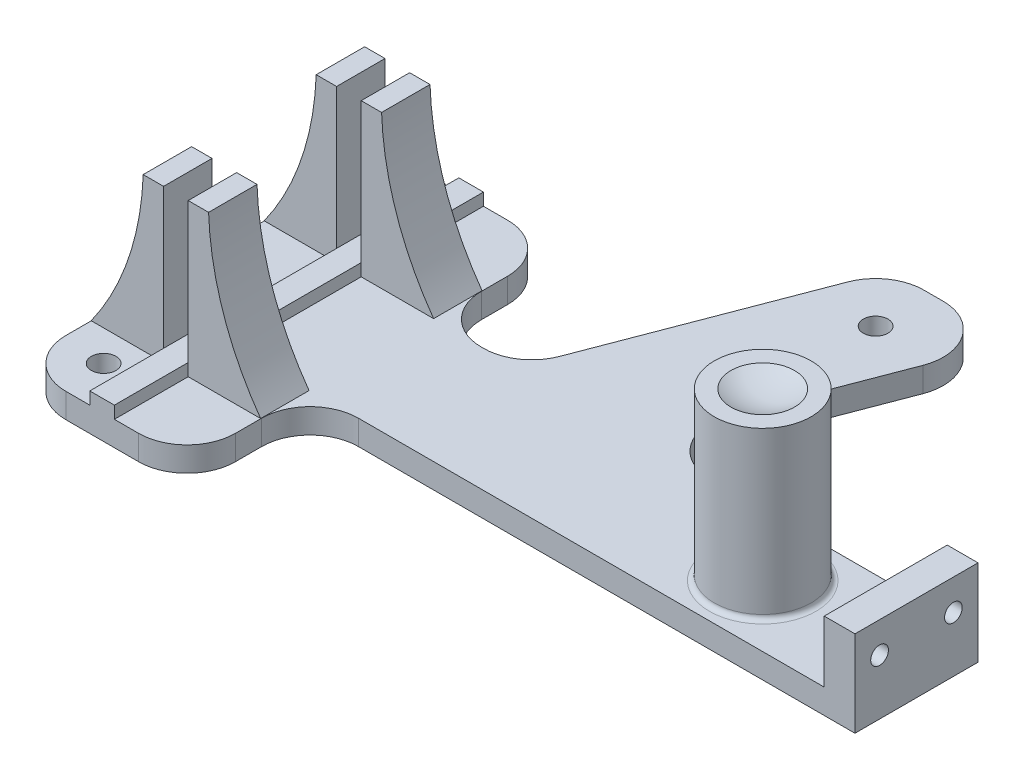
ISO-10303-21;
HEADER;
FILE_DESCRIPTION(('STEP AP214'),'2;1');
FILE_NAME('part.step','',(''),(''),'','','');
FILE_SCHEMA(('AUTOMOTIVE_DESIGN { 1 0 10303 214 1 1 1 1 }'));
ENDSEC;
DATA;
#1=APPLICATION_CONTEXT('core data for automotive mechanical design processes');
#2=APPLICATION_PROTOCOL_DEFINITION('international standard','automotive_design',2000,#1);
#3=PRODUCT_CONTEXT('',#1,'mechanical');
#4=PRODUCT('Part','Part','',(#3));
#5=PRODUCT_RELATED_PRODUCT_CATEGORY('part','',(#4));
#6=PRODUCT_DEFINITION_FORMATION('','',#4);
#7=PRODUCT_DEFINITION_CONTEXT('part definition',#1,'design');
#8=PRODUCT_DEFINITION('design','',#6,#7);
#9=PRODUCT_DEFINITION_SHAPE('','',#8);
#10=(LENGTH_UNIT() NAMED_UNIT(*) SI_UNIT(.MILLI.,.METRE.));
#11=(NAMED_UNIT(*) PLANE_ANGLE_UNIT() SI_UNIT($,.RADIAN.));
#12=(NAMED_UNIT(*) SI_UNIT($,.STERADIAN.) SOLID_ANGLE_UNIT());
#13=UNCERTAINTY_MEASURE_WITH_UNIT(LENGTH_MEASURE(1.E-05),#10,'distance_accuracy_value','');
#14=(GEOMETRIC_REPRESENTATION_CONTEXT(3) GLOBAL_UNCERTAINTY_ASSIGNED_CONTEXT((#13)) GLOBAL_UNIT_ASSIGNED_CONTEXT((#10,
#11,#12)) REPRESENTATION_CONTEXT('',''));
#15=CARTESIAN_POINT('',(0.,0.,0.));
#16=DIRECTION('',(0.,0.,1.));
#17=DIRECTION('',(1.,0.,0.));
#18=AXIS2_PLACEMENT_3D('',#15,#16,#17);
#19=CARTESIAN_POINT('',(30.08,0.,22.7));
#20=DIRECTION('',(0.,1.,0.));
#21=DIRECTION('',(0.,0.,1.));
#22=AXIS2_PLACEMENT_3D('',#19,#20,#21);
#23=PLANE('',#22);
#24=CARTESIAN_POINT('',(-6.03,0.,29.21));
#25=DIRECTION('',(0.,1.,0.));
#26=DIRECTION('',(0.,0.,1.));
#27=AXIS2_PLACEMENT_3D('',#24,#25,#26);
#28=CIRCLE('',#27,2.54);
#29=CARTESIAN_POINT('',(-6.03,0.,31.75));
#30=VERTEX_POINT('',#29);
#31=EDGE_CURVE('E408',#30,#30,#28,.F.);
#32=ORIENTED_EDGE('',*,*,#31,.T.);
#33=EDGE_LOOP('',(#32));
#34=FACE_BOUND('',#33,.T.);
#35=DIRECTION('',(1.,0.,0.));
#36=VECTOR('',#35,1.);
#37=CARTESIAN_POINT('',(-4.92,0.,38.1));
#38=LINE('',#37,#36);
#39=CARTESIAN_POINT('',(-4.92,0.,38.1));
#40=VERTEX_POINT('',#39);
#41=CARTESIAN_POINT('',(0.,0.,38.1));
#42=VERTEX_POINT('',#41);
#43=EDGE_CURVE('E56',#40,#42,#38,.T.);
#44=ORIENTED_EDGE('',*,*,#43,.T.);
#45=DIRECTION('',(0.,0.,1.));
#46=VECTOR('',#45,1.);
#47=CARTESIAN_POINT('',(0.,0.,-38.1));
#48=LINE('',#47,#46);
#49=CARTESIAN_POINT('',(0.,0.,22.86));
#50=VERTEX_POINT('',#49);
#51=EDGE_CURVE('E378',#50,#42,#48,.T.);
#52=ORIENTED_EDGE('',*,*,#51,.F.);
#53=DIRECTION('',(1.,0.,0.));
#54=VECTOR('',#53,1.);
#55=CARTESIAN_POINT('',(0.,0.,22.86));
#56=LINE('',#55,#54);
#57=CARTESIAN_POINT('',(-14.92,0.,22.86));
#58=VERTEX_POINT('',#57);
#59=EDGE_CURVE('E609',#58,#50,#56,.T.);
#60=ORIENTED_EDGE('',*,*,#59,.F.);
#61=DIRECTION('',(0.,0.,1.));
#62=VECTOR('',#61,1.);
#63=CARTESIAN_POINT('',(-14.92,0.,-28.1));
#64=LINE('',#63,#62);
#65=CARTESIAN_POINT('',(-14.92,0.,28.1));
#66=VERTEX_POINT('',#65);
#67=EDGE_CURVE('E678',#58,#66,#64,.T.);
#68=ORIENTED_EDGE('',*,*,#67,.T.);
#69=CARTESIAN_POINT('',(-4.92,0.,28.1));
#70=DIRECTION('',(0.,1.,0.));
#71=DIRECTION('',(0.,0.,1.));
#72=AXIS2_PLACEMENT_3D('',#69,#70,#71);
#73=CIRCLE('',#72,10.);
#74=EDGE_CURVE('E682',#66,#40,#73,.T.);
#75=ORIENTED_EDGE('',*,*,#74,.T.);
#76=EDGE_LOOP('',(#44,#52,#60,#68,#75));
#77=FACE_BOUND('',#76,.T.);
#78=ADVANCED_FACE('F33',(#34,#77),#23,.T.);
#79=DIRECTION('',(1.,0.,0.));
#80=VECTOR('',#79,1.);
#81=CARTESIAN_POINT('',(0.,0.,12.86));
#82=LINE('',#81,#80);
#83=CARTESIAN_POINT('',(-14.92,0.,12.86));
#84=VERTEX_POINT('',#83);
#85=CARTESIAN_POINT('',(0.,0.,12.86));
#86=VERTEX_POINT('',#85);
#87=EDGE_CURVE('E596',#84,#86,#82,.T.);
#88=ORIENTED_EDGE('',*,*,#87,.T.);
#89=CARTESIAN_POINT('',(0.,0.,-12.86));
#90=VERTEX_POINT('',#89);
#91=EDGE_CURVE('E1351',#90,#86,#48,.T.);
#92=ORIENTED_EDGE('',*,*,#91,.F.);
#93=DIRECTION('',(1.,0.,0.));
#94=VECTOR('',#93,1.);
#95=CARTESIAN_POINT('',(0.,0.,-12.86));
#96=LINE('',#95,#94);
#97=CARTESIAN_POINT('',(-14.92,0.,-12.86));
#98=VERTEX_POINT('',#97);
#99=EDGE_CURVE('E523',#98,#90,#96,.T.);
#100=ORIENTED_EDGE('',*,*,#99,.F.);
#101=EDGE_CURVE('E684',#98,#84,#64,.T.);
#102=ORIENTED_EDGE('',*,*,#101,.T.);
#103=EDGE_LOOP('',(#88,#92,#100,#102));
#104=FACE_BOUND('',#103,.T.);
#105=ADVANCED_FACE('F856',(#104),#23,.T.);
#106=CARTESIAN_POINT('',(-6.03,0.,-29.21));
#107=DIRECTION('',(0.,1.,0.));
#108=DIRECTION('',(0.,0.,1.));
#109=AXIS2_PLACEMENT_3D('',#106,#107,#108);
#110=CIRCLE('',#109,2.54);
#111=CARTESIAN_POINT('',(-6.03,0.,-26.67));
#112=VERTEX_POINT('',#111);
#113=EDGE_CURVE('E402',#112,#112,#110,.F.);
#114=ORIENTED_EDGE('',*,*,#113,.T.);
#115=EDGE_LOOP('',(#114));
#116=FACE_BOUND('',#115,.T.);
#117=DIRECTION('',(1.,0.,0.));
#118=VECTOR('',#117,1.);
#119=CARTESIAN_POINT('',(0.,0.,-22.86));
#120=LINE('',#119,#118);
#121=CARTESIAN_POINT('',(-14.92,0.,-22.86));
#122=VERTEX_POINT('',#121);
#123=CARTESIAN_POINT('',(0.,0.,-22.86));
#124=VERTEX_POINT('',#123);
#125=EDGE_CURVE('E536',#122,#124,#120,.T.);
#126=ORIENTED_EDGE('',*,*,#125,.T.);
#127=CARTESIAN_POINT('',(0.,0.,-38.1));
#128=VERTEX_POINT('',#127);
#129=EDGE_CURVE('E1348',#128,#124,#48,.T.);
#130=ORIENTED_EDGE('',*,*,#129,.F.);
#131=DIRECTION('',(-1.,0.,0.));
#132=VECTOR('',#131,1.);
#133=CARTESIAN_POINT('',(-4.92,0.,-38.1));
#134=LINE('',#133,#132);
#135=CARTESIAN_POINT('',(-4.91999999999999,0.,-38.1));
#136=VERTEX_POINT('',#135);
#137=EDGE_CURVE('E672',#128,#136,#134,.T.);
#138=ORIENTED_EDGE('',*,*,#137,.T.);
#139=CARTESIAN_POINT('',(-4.92,0.,-28.1));
#140=DIRECTION('',(0.,1.,0.));
#141=DIRECTION('',(0.,0.,1.));
#142=AXIS2_PLACEMENT_3D('',#139,#140,#141);
#143=CIRCLE('',#142,10.);
#144=CARTESIAN_POINT('',(-14.92,0.,-28.1));
#145=VERTEX_POINT('',#144);
#146=EDGE_CURVE('E675',#136,#145,#143,.T.);
#147=ORIENTED_EDGE('',*,*,#146,.T.);
#148=EDGE_CURVE('E679',#145,#122,#64,.T.);
#149=ORIENTED_EDGE('',*,*,#148,.T.);
#150=EDGE_LOOP('',(#126,#130,#138,#147,#149));
#151=FACE_BOUND('',#150,.T.);
#152=ADVANCED_FACE('F862',(#116,#151),#23,.T.);
#153=CARTESIAN_POINT('',(100.84,0.,0.));
#154=DIRECTION('',(0.,1.,0.));
#155=DIRECTION('',(0.,0.,1.));
#156=AXIS2_PLACEMENT_3D('',#153,#154,#155);
#157=CIRCLE('',#156,11.);
#158=CARTESIAN_POINT('',(100.84,0.,11.));
#159=VERTEX_POINT('',#158);
#160=EDGE_CURVE('E733',#159,#159,#157,.F.);
#161=ORIENTED_EDGE('',*,*,#160,.T.);
#162=EDGE_LOOP('',(#161));
#163=FACE_BOUND('',#162,.T.);
#164=CARTESIAN_POINT('',(67.0011743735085,0.,-57.15));
#165=DIRECTION('',(0.,1.,0.));
#166=DIRECTION('',(0.,0.,1.));
#167=AXIS2_PLACEMENT_3D('',#164,#165,#166);
#168=CIRCLE('',#167,2.54);
#169=CARTESIAN_POINT('',(67.0011743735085,0.,-54.61));
#170=VERTEX_POINT('',#169);
#171=EDGE_CURVE('E396',#170,#170,#168,.F.);
#172=ORIENTED_EDGE('',*,*,#171,.T.);
#173=EDGE_LOOP('',(#172));
#174=FACE_BOUND('',#173,.T.);
#175=CARTESIAN_POINT('',(118.62,0.,0.));
#176=DIRECTION('',(0.,1.,0.));
#177=DIRECTION('',(0.,0.,1.));
#178=AXIS2_PLACEMENT_3D('',#175,#176,#177);
#179=CIRCLE('',#178,2.54);
#180=CARTESIAN_POINT('',(118.62,0.,2.54));
#181=VERTEX_POINT('',#180);
#182=EDGE_CURVE('E392',#181,#181,#179,.F.);
#183=ORIENTED_EDGE('',*,*,#182,.T.);
#184=EDGE_LOOP('',(#183));
#185=FACE_BOUND('',#184,.T.);
#186=CARTESIAN_POINT('',(10.08,0.,-38.1));
#187=VERTEX_POINT('',#186);
#188=CARTESIAN_POINT('',(5.08000000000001,0.,-38.1));
#189=VERTEX_POINT('',#188);
#190=EDGE_CURVE('E673',#187,#189,#134,.T.);
#191=ORIENTED_EDGE('',*,*,#190,.T.);
#192=DIRECTION('',(0.,0.,-1.));
#193=VECTOR('',#192,1.);
#194=CARTESIAN_POINT('',(5.08,0.,-38.1));
#195=LINE('',#194,#193);
#196=CARTESIAN_POINT('',(5.08,0.,-22.86));
#197=VERTEX_POINT('',#196);
#198=EDGE_CURVE('E1321',#197,#189,#195,.T.);
#199=ORIENTED_EDGE('',*,*,#198,.F.);
#200=DIRECTION('',(1.,0.,0.));
#201=VECTOR('',#200,1.);
#202=CARTESIAN_POINT('',(5.08,0.,-22.86));
#203=LINE('',#202,#201);
#204=CARTESIAN_POINT('',(20.033299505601,0.,-22.86));
#205=VERTEX_POINT('',#204);
#206=EDGE_CURVE('E495',#197,#205,#203,.T.);
#207=ORIENTED_EDGE('',*,*,#206,.T.);
#208=DIRECTION('',(0.,0.,-1.));
#209=VECTOR('',#208,1.);
#210=CARTESIAN_POINT('',(20.033299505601,0.,-12.86));
#211=LINE('',#210,#209);
#212=CARTESIAN_POINT('',(20.033299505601,0.,-12.86));
#213=VERTEX_POINT('',#212);
#214=EDGE_CURVE('E511',#213,#205,#211,.T.);
#215=ORIENTED_EDGE('',*,*,#214,.F.);
#216=DIRECTION('',(1.,0.,0.));
#217=VECTOR('',#216,1.);
#218=CARTESIAN_POINT('',(5.08,0.,-12.86));
#219=LINE('',#218,#217);
#220=CARTESIAN_POINT('',(5.08,0.,-12.86));
#221=VERTEX_POINT('',#220);
#222=EDGE_CURVE('E499',#221,#213,#219,.T.);
#223=ORIENTED_EDGE('',*,*,#222,.F.);
#224=CARTESIAN_POINT('',(5.08,0.,12.86));
#225=VERTEX_POINT('',#224);
#226=EDGE_CURVE('E1340',#225,#221,#195,.T.);
#227=ORIENTED_EDGE('',*,*,#226,.F.);
#228=DIRECTION('',(1.,0.,0.));
#229=VECTOR('',#228,1.);
#230=CARTESIAN_POINT('',(5.08,0.,12.86));
#231=LINE('',#230,#229);
#232=CARTESIAN_POINT('',(20.033299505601,0.,12.86));
#233=VERTEX_POINT('',#232);
#234=EDGE_CURVE('E556',#225,#233,#231,.T.);
#235=ORIENTED_EDGE('',*,*,#234,.T.);
#236=DIRECTION('',(0.,0.,1.));
#237=VECTOR('',#236,1.);
#238=CARTESIAN_POINT('',(20.033299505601,0.,12.86));
#239=LINE('',#238,#237);
#240=CARTESIAN_POINT('',(20.033299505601,0.,22.86));
#241=VERTEX_POINT('',#240);
#242=EDGE_CURVE('E565',#233,#241,#239,.T.);
#243=ORIENTED_EDGE('',*,*,#242,.T.);
#244=DIRECTION('',(1.,0.,0.));
#245=VECTOR('',#244,1.);
#246=CARTESIAN_POINT('',(5.08,0.,22.86));
#247=LINE('',#246,#245);
#248=CARTESIAN_POINT('',(5.08,0.,22.86));
#249=VERTEX_POINT('',#248);
#250=EDGE_CURVE('E568',#249,#241,#247,.T.);
#251=ORIENTED_EDGE('',*,*,#250,.F.);
#252=CARTESIAN_POINT('',(5.08000000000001,0.,38.1));
#253=VERTEX_POINT('',#252);
#254=EDGE_CURVE('E48',#253,#249,#195,.T.);
#255=ORIENTED_EDGE('',*,*,#254,.F.);
#256=CARTESIAN_POINT('',(10.08,0.,38.1));
#257=VERTEX_POINT('',#256);
#258=EDGE_CURVE('E687',#253,#257,#38,.T.);
#259=ORIENTED_EDGE('',*,*,#258,.T.);
#260=CARTESIAN_POINT('',(10.08,0.,28.1));
#261=DIRECTION('',(0.,1.,0.));
#262=DIRECTION('',(0.,0.,-1.));
#263=AXIS2_PLACEMENT_3D('',#260,#261,#262);
#264=CIRCLE('',#263,10.);
#265=CARTESIAN_POINT('',(20.08,0.,28.1));
#266=VERTEX_POINT('',#265);
#267=EDGE_CURVE('E689',#257,#266,#264,.T.);
#268=ORIENTED_EDGE('',*,*,#267,.T.);
#269=DIRECTION('',(0.,0.,-1.));
#270=VECTOR('',#269,1.);
#271=CARTESIAN_POINT('',(20.08,0.,28.1));
#272=LINE('',#271,#270);
#273=CARTESIAN_POINT('',(20.08,0.,22.7));
#274=VERTEX_POINT('',#273);
#275=EDGE_CURVE('E692',#266,#274,#272,.T.);
#276=ORIENTED_EDGE('',*,*,#275,.T.);
#277=CARTESIAN_POINT('',(30.08,0.,22.7));
#278=DIRECTION('',(0.,-1.,0.));
#279=DIRECTION('',(0.,0.,1.));
#280=AXIS2_PLACEMENT_3D('',#277,#278,#279);
#281=CIRCLE('',#280,10.);
#282=CARTESIAN_POINT('',(30.08,0.,12.7));
#283=VERTEX_POINT('',#282);
#284=EDGE_CURVE('E695',#274,#283,#281,.T.);
#285=ORIENTED_EDGE('',*,*,#284,.T.);
#286=DIRECTION('',(1.,0.,0.));
#287=VECTOR('',#286,1.);
#288=CARTESIAN_POINT('',(30.08,0.,12.7));
#289=LINE('',#288,#287);
#290=CARTESIAN_POINT('',(126.24,0.,12.7));
#291=VERTEX_POINT('',#290);
#292=EDGE_CURVE('E621',#283,#291,#289,.T.);
#293=ORIENTED_EDGE('',*,*,#292,.T.);
#294=DIRECTION('',(0.,0.,1.));
#295=VECTOR('',#294,1.);
#296=CARTESIAN_POINT('',(126.24,0.,12.7));
#297=LINE('',#296,#295);
#298=CARTESIAN_POINT('',(126.24,0.,-12.7));
#299=VERTEX_POINT('',#298);
#300=EDGE_CURVE('E428',#299,#291,#297,.T.);
#301=ORIENTED_EDGE('',*,*,#300,.F.);
#302=DIRECTION('',(-1.,0.,0.));
#303=VECTOR('',#302,1.);
#304=CARTESIAN_POINT('',(30.08,0.,-12.7));
#305=LINE('',#304,#303);
#306=CARTESIAN_POINT('',(77.2590686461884,0.,-12.7));
#307=VERTEX_POINT('',#306);
#308=EDGE_CURVE('E661',#299,#307,#305,.T.);
#309=ORIENTED_EDGE('',*,*,#308,.T.);
#310=CARTESIAN_POINT('',(77.2590686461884,0.,-22.7));
#311=DIRECTION('',(0.,1.,0.));
#312=DIRECTION('',(0.,0.,1.));
#313=AXIS2_PLACEMENT_3D('',#310,#311,#312);
#314=CIRCLE('',#313,10.);
#315=CARTESIAN_POINT('',(67.9161394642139,0.,-26.2650630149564));
#316=VERTEX_POINT('',#315);
#317=EDGE_CURVE('E41',#307,#316,#314,.F.);
#318=ORIENTED_EDGE('',*,*,#317,.T.);
#319=DIRECTION('',(0.356506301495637,0.,-0.934292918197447));
#320=VECTOR('',#319,1.);
#321=CARTESIAN_POINT('',(78.8864797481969,0.,-55.0149369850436));
#322=LINE('',#321,#320);
#323=CARTESIAN_POINT('',(78.8864797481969,0.,-55.0149369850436));
#324=VERTEX_POINT('',#323);
#325=EDGE_CURVE('E447',#316,#324,#322,.T.);
#326=ORIENTED_EDGE('',*,*,#325,.T.);
#327=CARTESIAN_POINT('',(69.5435505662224,0.,-58.58));
#328=DIRECTION('',(0.,1.,0.));
#329=DIRECTION('',(0.,0.,-1.));
#330=AXIS2_PLACEMENT_3D('',#327,#328,#329);
#331=CIRCLE('',#330,10.);
#332=CARTESIAN_POINT('',(69.5435505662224,0.,-68.58));
#333=VERTEX_POINT('',#332);
#334=EDGE_CURVE('E465',#324,#333,#331,.T.);
#335=ORIENTED_EDGE('',*,*,#334,.T.);
#336=DIRECTION('',(-1.,0.,0.));
#337=VECTOR('',#336,1.);
#338=CARTESIAN_POINT('',(65.5501133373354,0.,-68.58));
#339=LINE('',#338,#337);
#340=CARTESIAN_POINT('',(65.5501133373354,0.,-68.58));
#341=VERTEX_POINT('',#340);
#342=EDGE_CURVE('E468',#333,#341,#339,.T.);
#343=ORIENTED_EDGE('',*,*,#342,.T.);
#344=CARTESIAN_POINT('',(65.5501133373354,0.,-58.58));
#345=DIRECTION('',(0.,1.,0.));
#346=DIRECTION('',(0.,0.,-1.));
#347=AXIS2_PLACEMENT_3D('',#344,#345,#346);
#348=CIRCLE('',#347,10.);
#349=CARTESIAN_POINT('',(56.2071841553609,0.,-62.1450630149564));
#350=VERTEX_POINT('',#349);
#351=EDGE_CURVE('E471',#341,#350,#348,.T.);
#352=ORIENTED_EDGE('',*,*,#351,.T.);
#353=DIRECTION('',(-0.356506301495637,0.,0.934292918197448));
#354=VECTOR('',#353,1.);
#355=CARTESIAN_POINT('',(37.34,0.,-12.7));
#356=LINE('',#355,#354);
#357=CARTESIAN_POINT('',(39.7954350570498,0.,-19.1349369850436));
#358=VERTEX_POINT('',#357);
#359=EDGE_CURVE('E451',#350,#358,#356,.T.);
#360=ORIENTED_EDGE('',*,*,#359,.T.);
#361=CARTESIAN_POINT('',(30.4525058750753,0.,-22.7));
#362=DIRECTION('',(0.,1.,0.));
#363=DIRECTION('',(0.,0.,1.));
#364=AXIS2_PLACEMENT_3D('',#361,#362,#363);
#365=CIRCLE('',#364,10.);
#366=CARTESIAN_POINT('',(30.4525058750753,0.,-12.7));
#367=VERTEX_POINT('',#366);
#368=EDGE_CURVE('E741',#358,#367,#365,.F.);
#369=ORIENTED_EDGE('',*,*,#368,.T.);
#370=CARTESIAN_POINT('',(30.08,0.,-12.7));
#371=VERTEX_POINT('',#370);
#372=EDGE_CURVE('E612',#367,#371,#305,.T.);
#373=ORIENTED_EDGE('',*,*,#372,.T.);
#374=CARTESIAN_POINT('',(30.08,0.,-22.7));
#375=DIRECTION('',(0.,-1.,0.));
#376=DIRECTION('',(0.,0.,1.));
#377=AXIS2_PLACEMENT_3D('',#374,#375,#376);
#378=CIRCLE('',#377,10.);
#379=CARTESIAN_POINT('',(20.08,0.,-22.7));
#380=VERTEX_POINT('',#379);
#381=EDGE_CURVE('E663',#371,#380,#378,.T.);
#382=ORIENTED_EDGE('',*,*,#381,.T.);
#383=DIRECTION('',(0.,0.,-1.));
#384=VECTOR('',#383,1.);
#385=CARTESIAN_POINT('',(20.08,0.,-28.1));
#386=LINE('',#385,#384);
#387=CARTESIAN_POINT('',(20.08,0.,-28.1));
#388=VERTEX_POINT('',#387);
#389=EDGE_CURVE('E666',#380,#388,#386,.T.);
#390=ORIENTED_EDGE('',*,*,#389,.T.);
#391=CARTESIAN_POINT('',(10.08,0.,-28.1));
#392=DIRECTION('',(0.,1.,0.));
#393=DIRECTION('',(0.,0.,1.));
#394=AXIS2_PLACEMENT_3D('',#391,#392,#393);
#395=CIRCLE('',#394,10.);
#396=EDGE_CURVE('E669',#388,#187,#395,.T.);
#397=ORIENTED_EDGE('',*,*,#396,.T.);
#398=EDGE_LOOP('',(#191,#199,#207,#215,#223,#227,#235,#243,#251,#255,#259,#268,#276,#285,#293,
#301,#309,#318,#326,#335,#343,#352,#360,#369,#373,#382,#390,#397));
#399=FACE_BOUND('',#398,.T.);
#400=ADVANCED_FACE('F751',(#163,#174,#185,#399),#23,.T.);
#401=CARTESIAN_POINT('',(30.08,-5.08,-12.7));
#402=DIRECTION('',(0.,0.,-1.));
#403=DIRECTION('',(-1.,0.,0.));
#404=AXIS2_PLACEMENT_3D('',#401,#402,#403);
#405=PLANE('',#404);
#406=ORIENTED_EDGE('',*,*,#372,.F.);
#407=DIRECTION('',(0.,1.,0.));
#408=VECTOR('',#407,1.);
#409=CARTESIAN_POINT('',(30.4525058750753,-5.08,-12.7));
#410=LINE('',#409,#408);
#411=CARTESIAN_POINT('',(30.4525058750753,-5.08,-12.7));
#412=VERTEX_POINT('',#411);
#413=EDGE_CURVE('E739',#367,#412,#410,.F.);
#414=ORIENTED_EDGE('',*,*,#413,.T.);
#415=DIRECTION('',(-1.,0.,0.));
#416=VECTOR('',#415,1.);
#417=CARTESIAN_POINT('',(132.59,-5.08,-12.7));
#418=LINE('',#417,#416);
#419=CARTESIAN_POINT('',(30.08,-5.08,-12.7));
#420=VERTEX_POINT('',#419);
#421=EDGE_CURVE('E623',#412,#420,#418,.T.);
#422=ORIENTED_EDGE('',*,*,#421,.T.);
#423=DIRECTION('',(0.,1.,0.));
#424=VECTOR('',#423,1.);
#425=CARTESIAN_POINT('',(30.08,-5.08,-12.7));
#426=LINE('',#425,#424);
#427=EDGE_CURVE('E724',#420,#371,#426,.T.);
#428=ORIENTED_EDGE('',*,*,#427,.T.);
#429=EDGE_LOOP('',(#406,#414,#422,#428));
#430=FACE_BOUND('',#429,.T.);
#431=ADVANCED_FACE('F867',(#430),#405,.T.);
#432=CARTESIAN_POINT('',(30.08,-5.08,12.7));
#433=DIRECTION('',(0.,0.,1.));
#434=DIRECTION('',(1.,0.,0.));
#435=AXIS2_PLACEMENT_3D('',#432,#433,#434);
#436=PLANE('',#435);
#437=ORIENTED_EDGE('',*,*,#292,.F.);
#438=DIRECTION('',(0.,1.,0.));
#439=VECTOR('',#438,1.);
#440=CARTESIAN_POINT('',(30.08,-5.08,12.7));
#441=LINE('',#440,#439);
#442=CARTESIAN_POINT('',(30.08,-5.08,12.7));
#443=VERTEX_POINT('',#442);
#444=EDGE_CURVE('E699',#443,#283,#441,.T.);
#445=ORIENTED_EDGE('',*,*,#444,.F.);
#446=DIRECTION('',(1.,0.,0.));
#447=VECTOR('',#446,1.);
#448=CARTESIAN_POINT('',(132.59,-5.08,12.7));
#449=LINE('',#448,#447);
#450=CARTESIAN_POINT('',(132.59,-5.08,12.7));
#451=VERTEX_POINT('',#450);
#452=EDGE_CURVE('E617',#443,#451,#449,.T.);
#453=ORIENTED_EDGE('',*,*,#452,.T.);
#454=DIRECTION('',(0.,1.,0.));
#455=VECTOR('',#454,1.);
#456=CARTESIAN_POINT('',(132.59,-5.08,12.7));
#457=LINE('',#456,#455);
#458=CARTESIAN_POINT('',(132.59,12.7,12.7));
#459=VERTEX_POINT('',#458);
#460=EDGE_CURVE('E660',#451,#459,#457,.T.);
#461=ORIENTED_EDGE('',*,*,#460,.T.);
#462=DIRECTION('',(1.,0.,0.));
#463=VECTOR('',#462,1.);
#464=CARTESIAN_POINT('',(132.59,12.7,12.7));
#465=LINE('',#464,#463);
#466=CARTESIAN_POINT('',(126.24,12.7,12.7));
#467=VERTEX_POINT('',#466);
#468=EDGE_CURVE('E436',#467,#459,#465,.T.);
#469=ORIENTED_EDGE('',*,*,#468,.F.);
#470=DIRECTION('',(0.,-1.,0.));
#471=VECTOR('',#470,1.);
#472=CARTESIAN_POINT('',(126.24,12.7,12.7));
#473=LINE('',#472,#471);
#474=EDGE_CURVE('E439',#467,#291,#473,.T.);
#475=ORIENTED_EDGE('',*,*,#474,.T.);
#476=EDGE_LOOP('',(#437,#445,#453,#461,#469,#475));
#477=FACE_BOUND('',#476,.T.);
#478=ADVANCED_FACE('F779',(#477),#436,.T.);
#479=CARTESIAN_POINT('',(30.08,-5.08,22.7));
#480=DIRECTION('',(0.,1.,0.));
#481=DIRECTION('',(0.,0.,1.));
#482=AXIS2_PLACEMENT_3D('',#479,#480,#481);
#483=CYLINDRICAL_SURFACE('',#482,10.);
#484=ORIENTED_EDGE('',*,*,#284,.F.);
#485=DIRECTION('',(0.,1.,0.));
#486=VECTOR('',#485,1.);
#487=CARTESIAN_POINT('',(20.08,-5.08,22.7));
#488=LINE('',#487,#486);
#489=CARTESIAN_POINT('',(20.08,-5.08,22.7));
#490=VERTEX_POINT('',#489);
#491=EDGE_CURVE('E701',#490,#274,#488,.T.);
#492=ORIENTED_EDGE('',*,*,#491,.F.);
#493=CARTESIAN_POINT('',(30.08,-5.08,22.7));
#494=DIRECTION('',(0.,-1.,0.));
#495=DIRECTION('',(0.,0.,1.));
#496=AXIS2_PLACEMENT_3D('',#493,#494,#495);
#497=CIRCLE('',#496,10.);
#498=EDGE_CURVE('E657',#490,#443,#497,.T.);
#499=ORIENTED_EDGE('',*,*,#498,.T.);
#500=ORIENTED_EDGE('',*,*,#444,.T.);
#501=EDGE_LOOP('',(#484,#492,#499,#500));
#502=FACE_BOUND('',#501,.T.);
#503=ADVANCED_FACE('F783',(#502),#483,.F.);
#504=CARTESIAN_POINT('',(20.08,-5.08,28.1));
#505=DIRECTION('',(1.,0.,0.));
#506=DIRECTION('',(0.,0.,-1.));
#507=AXIS2_PLACEMENT_3D('',#504,#505,#506);
#508=PLANE('',#507);
#509=ORIENTED_EDGE('',*,*,#275,.F.);
#510=DIRECTION('',(0.,1.,0.));
#511=VECTOR('',#510,1.);
#512=CARTESIAN_POINT('',(20.08,-5.08,28.1));
#513=LINE('',#512,#511);
#514=CARTESIAN_POINT('',(20.08,-5.08,28.1));
#515=VERTEX_POINT('',#514);
#516=EDGE_CURVE('E703',#515,#266,#513,.T.);
#517=ORIENTED_EDGE('',*,*,#516,.F.);
#518=DIRECTION('',(0.,0.,-1.));
#519=VECTOR('',#518,1.);
#520=CARTESIAN_POINT('',(20.08,-5.08,28.1));
#521=LINE('',#520,#519);
#522=EDGE_CURVE('E654',#515,#490,#521,.T.);
#523=ORIENTED_EDGE('',*,*,#522,.T.);
#524=ORIENTED_EDGE('',*,*,#491,.T.);
#525=EDGE_LOOP('',(#509,#517,#523,#524));
#526=FACE_BOUND('',#525,.T.);
#527=ADVANCED_FACE('F788',(#526),#508,.T.);
#528=CARTESIAN_POINT('',(10.08,-5.08,28.1));
#529=DIRECTION('',(0.,1.,0.));
#530=DIRECTION('',(0.,0.,1.));
#531=AXIS2_PLACEMENT_3D('',#528,#529,#530);
#532=CYLINDRICAL_SURFACE('',#531,10.);
#533=ORIENTED_EDGE('',*,*,#267,.F.);
#534=DIRECTION('',(0.,1.,0.));
#535=VECTOR('',#534,1.);
#536=CARTESIAN_POINT('',(10.08,-5.08,38.1));
#537=LINE('',#536,#535);
#538=CARTESIAN_POINT('',(10.08,-5.08,38.1));
#539=VERTEX_POINT('',#538);
#540=EDGE_CURVE('E705',#539,#257,#537,.T.);
#541=ORIENTED_EDGE('',*,*,#540,.F.);
#542=CARTESIAN_POINT('',(10.08,-5.08,28.1));
#543=DIRECTION('',(0.,1.,0.));
#544=DIRECTION('',(0.,0.,-1.));
#545=AXIS2_PLACEMENT_3D('',#542,#543,#544);
#546=CIRCLE('',#545,10.);
#547=EDGE_CURVE('E651',#539,#515,#546,.T.);
#548=ORIENTED_EDGE('',*,*,#547,.T.);
#549=ORIENTED_EDGE('',*,*,#516,.T.);
#550=EDGE_LOOP('',(#533,#541,#548,#549));
#551=FACE_BOUND('',#550,.T.);
#552=ADVANCED_FACE('F791',(#551),#532,.T.);
#553=CARTESIAN_POINT('',(-4.92,-5.08,38.1));
#554=DIRECTION('',(0.,0.,1.));
#555=DIRECTION('',(1.,0.,0.));
#556=AXIS2_PLACEMENT_3D('',#553,#554,#555);
#557=PLANE('',#556);
#558=ORIENTED_EDGE('',*,*,#43,.F.);
#559=DIRECTION('',(0.,1.,0.));
#560=VECTOR('',#559,1.);
#561=CARTESIAN_POINT('',(-4.92,-5.08,38.1));
#562=LINE('',#561,#560);
#563=CARTESIAN_POINT('',(-4.92,-5.08,38.1));
#564=VERTEX_POINT('',#563);
#565=EDGE_CURVE('E708',#564,#40,#562,.T.);
#566=ORIENTED_EDGE('',*,*,#565,.F.);
#567=DIRECTION('',(1.,0.,0.));
#568=VECTOR('',#567,1.);
#569=CARTESIAN_POINT('',(-4.92,-5.08,38.1));
#570=LINE('',#569,#568);
#571=EDGE_CURVE('E648',#564,#539,#570,.T.);
#572=ORIENTED_EDGE('',*,*,#571,.T.);
#573=ORIENTED_EDGE('',*,*,#540,.T.);
#574=ORIENTED_EDGE('',*,*,#258,.F.);
#575=DIRECTION('',(0.,-1.,0.));
#576=VECTOR('',#575,1.);
#577=CARTESIAN_POINT('',(5.08000000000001,2.54,38.1));
#578=LINE('',#577,#576);
#579=CARTESIAN_POINT('',(5.08000000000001,2.54,38.1));
#580=VERTEX_POINT('',#579);
#581=EDGE_CURVE('E373',#580,#253,#578,.T.);
#582=ORIENTED_EDGE('',*,*,#581,.F.);
#583=DIRECTION('',(1.,0.,0.));
#584=VECTOR('',#583,1.);
#585=CARTESIAN_POINT('',(0.,2.54,38.1));
#586=LINE('',#585,#584);
#587=CARTESIAN_POINT('',(0.,2.54,38.1));
#588=VERTEX_POINT('',#587);
#589=EDGE_CURVE('E359',#588,#580,#586,.T.);
#590=ORIENTED_EDGE('',*,*,#589,.F.);
#591=DIRECTION('',(0.,-1.,0.));
#592=VECTOR('',#591,1.);
#593=CARTESIAN_POINT('',(0.,2.54,38.1));
#594=LINE('',#593,#592);
#595=EDGE_CURVE('E371',#588,#42,#594,.T.);
#596=ORIENTED_EDGE('',*,*,#595,.T.);
#597=EDGE_LOOP('',(#558,#566,#572,#573,#574,#582,#590,#596));
#598=FACE_BOUND('',#597,.T.);
#599=ADVANCED_FACE('F370',(#598),#557,.T.);
#600=CARTESIAN_POINT('',(-4.92,-5.08,28.1));
#601=DIRECTION('',(0.,1.,0.));
#602=DIRECTION('',(0.,0.,1.));
#603=AXIS2_PLACEMENT_3D('',#600,#601,#602);
#604=CYLINDRICAL_SURFACE('',#603,10.);
#605=ORIENTED_EDGE('',*,*,#74,.F.);
#606=DIRECTION('',(0.,1.,0.));
#607=VECTOR('',#606,1.);
#608=CARTESIAN_POINT('',(-14.92,-5.08,28.1));
#609=LINE('',#608,#607);
#610=CARTESIAN_POINT('',(-14.92,-5.08,28.1));
#611=VERTEX_POINT('',#610);
#612=EDGE_CURVE('E710',#611,#66,#609,.T.);
#613=ORIENTED_EDGE('',*,*,#612,.F.);
#614=CARTESIAN_POINT('',(-4.92,-5.08,28.1));
#615=DIRECTION('',(0.,1.,0.));
#616=DIRECTION('',(0.,0.,1.));
#617=AXIS2_PLACEMENT_3D('',#614,#615,#616);
#618=CIRCLE('',#617,10.);
#619=EDGE_CURVE('E645',#611,#564,#618,.T.);
#620=ORIENTED_EDGE('',*,*,#619,.T.);
#621=ORIENTED_EDGE('',*,*,#565,.T.);
#622=EDGE_LOOP('',(#605,#613,#620,#621));
#623=FACE_BOUND('',#622,.T.);
#624=ADVANCED_FACE('F796',(#623),#604,.T.);
#625=CARTESIAN_POINT('',(-14.92,-5.08,-28.1));
#626=DIRECTION('',(-1.,0.,0.));
#627=DIRECTION('',(0.,0.,1.));
#628=AXIS2_PLACEMENT_3D('',#625,#626,#627);
#629=PLANE('',#628);
#630=ORIENTED_EDGE('',*,*,#148,.F.);
#631=DIRECTION('',(0.,1.,0.));
#632=VECTOR('',#631,1.);
#633=CARTESIAN_POINT('',(-14.92,-5.08,-28.1));
#634=LINE('',#633,#632);
#635=CARTESIAN_POINT('',(-14.92,-5.08,-28.1));
#636=VERTEX_POINT('',#635);
#637=EDGE_CURVE('E713',#636,#145,#634,.T.);
#638=ORIENTED_EDGE('',*,*,#637,.F.);
#639=DIRECTION('',(0.,0.,1.));
#640=VECTOR('',#639,1.);
#641=CARTESIAN_POINT('',(-14.92,-5.08,-28.1));
#642=LINE('',#641,#640);
#643=EDGE_CURVE('E642',#636,#611,#642,.T.);
#644=ORIENTED_EDGE('',*,*,#643,.T.);
#645=ORIENTED_EDGE('',*,*,#612,.T.);
#646=ORIENTED_EDGE('',*,*,#67,.F.);
#647=EDGE_CURVE('E685',#84,#58,#64,.T.);
#648=ORIENTED_EDGE('',*,*,#647,.F.);
#649=ORIENTED_EDGE('',*,*,#101,.F.);
#650=EDGE_CURVE('E683',#122,#98,#64,.T.);
#651=ORIENTED_EDGE('',*,*,#650,.F.);
#652=EDGE_LOOP('',(#630,#638,#644,#645,#646,#648,#649,#651));
#653=FACE_BOUND('',#652,.T.);
#654=ADVANCED_FACE('F801',(#653),#629,.T.);
#655=CARTESIAN_POINT('',(-4.92,-5.08,-28.1));
#656=DIRECTION('',(0.,1.,0.));
#657=DIRECTION('',(0.,0.,1.));
#658=AXIS2_PLACEMENT_3D('',#655,#656,#657);
#659=CYLINDRICAL_SURFACE('',#658,10.);
#660=ORIENTED_EDGE('',*,*,#146,.F.);
#661=DIRECTION('',(0.,1.,0.));
#662=VECTOR('',#661,1.);
#663=CARTESIAN_POINT('',(-4.91999999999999,-5.08,-38.1));
#664=LINE('',#663,#662);
#665=CARTESIAN_POINT('',(-4.91999999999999,-5.08,-38.1));
#666=VERTEX_POINT('',#665);
#667=EDGE_CURVE('E715',#666,#136,#664,.T.);
#668=ORIENTED_EDGE('',*,*,#667,.F.);
#669=CARTESIAN_POINT('',(-4.92,-5.08,-28.1));
#670=DIRECTION('',(0.,1.,0.));
#671=DIRECTION('',(0.,0.,1.));
#672=AXIS2_PLACEMENT_3D('',#669,#670,#671);
#673=CIRCLE('',#672,10.);
#674=EDGE_CURVE('E639',#666,#636,#673,.T.);
#675=ORIENTED_EDGE('',*,*,#674,.T.);
#676=ORIENTED_EDGE('',*,*,#637,.T.);
#677=EDGE_LOOP('',(#660,#668,#675,#676));
#678=FACE_BOUND('',#677,.T.);
#679=ADVANCED_FACE('F805',(#678),#659,.T.);
#680=CARTESIAN_POINT('',(-4.92,-5.08,-38.1));
#681=DIRECTION('',(0.,0.,-1.));
#682=DIRECTION('',(-1.,0.,0.));
#683=AXIS2_PLACEMENT_3D('',#680,#681,#682);
#684=PLANE('',#683);
#685=ORIENTED_EDGE('',*,*,#190,.F.);
#686=DIRECTION('',(0.,1.,0.));
#687=VECTOR('',#686,1.);
#688=CARTESIAN_POINT('',(10.08,-5.08,-38.1));
#689=LINE('',#688,#687);
#690=CARTESIAN_POINT('',(10.08,-5.08,-38.1));
#691=VERTEX_POINT('',#690);
#692=EDGE_CURVE('E718',#691,#187,#689,.T.);
#693=ORIENTED_EDGE('',*,*,#692,.F.);
#694=DIRECTION('',(-1.,0.,0.));
#695=VECTOR('',#694,1.);
#696=CARTESIAN_POINT('',(-4.92,-5.08,-38.1));
#697=LINE('',#696,#695);
#698=EDGE_CURVE('E636',#691,#666,#697,.T.);
#699=ORIENTED_EDGE('',*,*,#698,.T.);
#700=ORIENTED_EDGE('',*,*,#667,.T.);
#701=ORIENTED_EDGE('',*,*,#137,.F.);
#702=DIRECTION('',(0.,-1.,0.));
#703=VECTOR('',#702,1.);
#704=CARTESIAN_POINT('',(0.,2.54,-38.1));
#705=LINE('',#704,#703);
#706=CARTESIAN_POINT('',(0.,2.54,-38.1));
#707=VERTEX_POINT('',#706);
#708=EDGE_CURVE('E1347',#707,#128,#705,.T.);
#709=ORIENTED_EDGE('',*,*,#708,.F.);
#710=DIRECTION('',(-1.,0.,0.));
#711=VECTOR('',#710,1.);
#712=CARTESIAN_POINT('',(0.,2.54,-38.1));
#713=LINE('',#712,#711);
#714=CARTESIAN_POINT('',(5.08,2.54,-38.1));
#715=VERTEX_POINT('',#714);
#716=EDGE_CURVE('E1345',#715,#707,#713,.T.);
#717=ORIENTED_EDGE('',*,*,#716,.F.);
#718=DIRECTION('',(0.,-1.,0.));
#719=VECTOR('',#718,1.);
#720=CARTESIAN_POINT('',(5.08,2.54,-38.1));
#721=LINE('',#720,#719);
#722=EDGE_CURVE('E384',#715,#189,#721,.T.);
#723=ORIENTED_EDGE('',*,*,#722,.T.);
#724=EDGE_LOOP('',(#685,#693,#699,#700,#701,#709,#717,#723));
#725=FACE_BOUND('',#724,.T.);
#726=ADVANCED_FACE('F810',(#725),#684,.T.);
#727=CARTESIAN_POINT('',(10.08,-5.08,-28.1));
#728=DIRECTION('',(0.,1.,0.));
#729=DIRECTION('',(0.,0.,1.));
#730=AXIS2_PLACEMENT_3D('',#727,#728,#729);
#731=CYLINDRICAL_SURFACE('',#730,10.);
#732=ORIENTED_EDGE('',*,*,#396,.F.);
#733=DIRECTION('',(0.,1.,0.));
#734=VECTOR('',#733,1.);
#735=CARTESIAN_POINT('',(20.08,-5.08,-28.1));
#736=LINE('',#735,#734);
#737=CARTESIAN_POINT('',(20.08,-5.08,-28.1));
#738=VERTEX_POINT('',#737);
#739=EDGE_CURVE('E720',#738,#388,#736,.T.);
#740=ORIENTED_EDGE('',*,*,#739,.F.);
#741=CARTESIAN_POINT('',(10.08,-5.08,-28.1));
#742=DIRECTION('',(0.,1.,0.));
#743=DIRECTION('',(0.,0.,1.));
#744=AXIS2_PLACEMENT_3D('',#741,#742,#743);
#745=CIRCLE('',#744,10.);
#746=EDGE_CURVE('E633',#738,#691,#745,.T.);
#747=ORIENTED_EDGE('',*,*,#746,.T.);
#748=ORIENTED_EDGE('',*,*,#692,.T.);
#749=EDGE_LOOP('',(#732,#740,#747,#748));
#750=FACE_BOUND('',#749,.T.);
#751=ADVANCED_FACE('F815',(#750),#731,.T.);
#752=CARTESIAN_POINT('',(20.08,-5.08,-28.1));
#753=DIRECTION('',(1.,0.,0.));
#754=DIRECTION('',(0.,0.,-1.));
#755=AXIS2_PLACEMENT_3D('',#752,#753,#754);
#756=PLANE('',#755);
#757=ORIENTED_EDGE('',*,*,#389,.F.);
#758=DIRECTION('',(0.,1.,0.));
#759=VECTOR('',#758,1.);
#760=CARTESIAN_POINT('',(20.08,-5.08,-22.7));
#761=LINE('',#760,#759);
#762=CARTESIAN_POINT('',(20.08,-5.08,-22.7));
#763=VERTEX_POINT('',#762);
#764=EDGE_CURVE('E722',#763,#380,#761,.T.);
#765=ORIENTED_EDGE('',*,*,#764,.F.);
#766=DIRECTION('',(0.,0.,-1.));
#767=VECTOR('',#766,1.);
#768=CARTESIAN_POINT('',(20.08,-5.08,-28.1));
#769=LINE('',#768,#767);
#770=EDGE_CURVE('E630',#763,#738,#769,.T.);
#771=ORIENTED_EDGE('',*,*,#770,.T.);
#772=ORIENTED_EDGE('',*,*,#739,.T.);
#773=EDGE_LOOP('',(#757,#765,#771,#772));
#774=FACE_BOUND('',#773,.T.);
#775=ADVANCED_FACE('F820',(#774),#756,.T.);
#776=CARTESIAN_POINT('',(30.08,-5.08,-22.7));
#777=DIRECTION('',(0.,1.,0.));
#778=DIRECTION('',(0.,0.,1.));
#779=AXIS2_PLACEMENT_3D('',#776,#777,#778);
#780=CYLINDRICAL_SURFACE('',#779,10.);
#781=ORIENTED_EDGE('',*,*,#381,.F.);
#782=ORIENTED_EDGE('',*,*,#427,.F.);
#783=CARTESIAN_POINT('',(30.08,-5.08,-22.7));
#784=DIRECTION('',(0.,-1.,0.));
#785=DIRECTION('',(0.,0.,1.));
#786=AXIS2_PLACEMENT_3D('',#783,#784,#785);
#787=CIRCLE('',#786,10.);
#788=EDGE_CURVE('E627',#420,#763,#787,.T.);
#789=ORIENTED_EDGE('',*,*,#788,.T.);
#790=ORIENTED_EDGE('',*,*,#764,.T.);
#791=EDGE_LOOP('',(#781,#782,#789,#790));
#792=FACE_BOUND('',#791,.T.);
#793=ADVANCED_FACE('F823',(#792),#780,.F.);
#794=CARTESIAN_POINT('',(132.59,-5.08,-12.7));
#795=VERTEX_POINT('',#794);
#796=CARTESIAN_POINT('',(77.2590686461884,-5.08,-12.7));
#797=VERTEX_POINT('',#796);
#798=EDGE_CURVE('E624',#795,#797,#418,.T.);
#799=ORIENTED_EDGE('',*,*,#798,.T.);
#800=DIRECTION('',(0.,1.,0.));
#801=VECTOR('',#800,1.);
#802=CARTESIAN_POINT('',(77.2590686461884,0.,-12.7));
#803=LINE('',#802,#801);
#804=EDGE_CURVE('E745',#797,#307,#803,.T.);
#805=ORIENTED_EDGE('',*,*,#804,.T.);
#806=ORIENTED_EDGE('',*,*,#308,.F.);
#807=DIRECTION('',(0.,-1.,0.));
#808=VECTOR('',#807,1.);
#809=CARTESIAN_POINT('',(126.24,12.7,-12.7));
#810=LINE('',#809,#808);
#811=CARTESIAN_POINT('',(126.24,12.7,-12.7));
#812=VERTEX_POINT('',#811);
#813=EDGE_CURVE('E444',#812,#299,#810,.T.);
#814=ORIENTED_EDGE('',*,*,#813,.F.);
#815=DIRECTION('',(-1.,0.,0.));
#816=VECTOR('',#815,1.);
#817=CARTESIAN_POINT('',(132.59,12.7,-12.7));
#818=LINE('',#817,#816);
#819=CARTESIAN_POINT('',(132.59,12.7,-12.7));
#820=VERTEX_POINT('',#819);
#821=EDGE_CURVE('E432',#820,#812,#818,.T.);
#822=ORIENTED_EDGE('',*,*,#821,.F.);
#823=DIRECTION('',(0.,1.,0.));
#824=VECTOR('',#823,1.);
#825=CARTESIAN_POINT('',(132.59,-5.08,-12.7));
#826=LINE('',#825,#824);
#827=EDGE_CURVE('E727',#795,#820,#826,.T.);
#828=ORIENTED_EDGE('',*,*,#827,.F.);
#829=EDGE_LOOP('',(#799,#805,#806,#814,#822,#828));
#830=FACE_BOUND('',#829,.T.);
#831=ADVANCED_FACE('F769',(#830),#405,.T.);
#832=CARTESIAN_POINT('',(132.59,-5.08,0.));
#833=DIRECTION('',(1.,0.,0.));
#834=DIRECTION('',(0.,0.,-1.));
#835=AXIS2_PLACEMENT_3D('',#832,#833,#834);
#836=PLANE('',#835);
#837=CARTESIAN_POINT('',(132.59,6.35,-7.62));
#838=DIRECTION('',(1.,0.,0.));
#839=DIRECTION('',(0.,0.,-1.));
#840=AXIS2_PLACEMENT_3D('',#837,#838,#839);
#841=CIRCLE('',#840,1.8288);
#842=CARTESIAN_POINT('',(132.59,6.35,-9.4488));
#843=VERTEX_POINT('',#842);
#844=EDGE_CURVE('E414',#843,#843,#841,.T.);
#845=ORIENTED_EDGE('',*,*,#844,.F.);
#846=EDGE_LOOP('',(#845));
#847=FACE_BOUND('',#846,.T.);
#848=CARTESIAN_POINT('',(132.59,6.35,7.62));
#849=DIRECTION('',(1.,0.,0.));
#850=DIRECTION('',(0.,0.,-1.));
#851=AXIS2_PLACEMENT_3D('',#848,#849,#850);
#852=CIRCLE('',#851,1.8288);
#853=CARTESIAN_POINT('',(132.59,6.35,5.7912));
#854=VERTEX_POINT('',#853);
#855=EDGE_CURVE('E422',#854,#854,#852,.T.);
#856=ORIENTED_EDGE('',*,*,#855,.F.);
#857=EDGE_LOOP('',(#856));
#858=FACE_BOUND('',#857,.T.);
#859=ORIENTED_EDGE('',*,*,#827,.T.);
#860=DIRECTION('',(0.,0.,-1.));
#861=VECTOR('',#860,1.);
#862=CARTESIAN_POINT('',(132.59,12.7,12.7));
#863=LINE('',#862,#861);
#864=EDGE_CURVE('E429',#459,#820,#863,.T.);
#865=ORIENTED_EDGE('',*,*,#864,.F.);
#866=ORIENTED_EDGE('',*,*,#460,.F.);
#867=DIRECTION('',(0.,0.,-1.));
#868=VECTOR('',#867,1.);
#869=CARTESIAN_POINT('',(132.59,-5.08,0.));
#870=LINE('',#869,#868);
#871=EDGE_CURVE('E620',#451,#795,#870,.T.);
#872=ORIENTED_EDGE('',*,*,#871,.T.);
#873=EDGE_LOOP('',(#859,#865,#866,#872));
#874=FACE_BOUND('',#873,.T.);
#875=ADVANCED_FACE('F774',(#847,#858,#874),#836,.T.);
#876=CARTESIAN_POINT('',(30.08,-5.08,22.7));
#877=DIRECTION('',(0.,1.,0.));
#878=DIRECTION('',(0.,0.,1.));
#879=AXIS2_PLACEMENT_3D('',#876,#877,#878);
#880=PLANE('',#879);
#881=CARTESIAN_POINT('',(118.62,-5.08,0.));
#882=DIRECTION('',(0.,-1.,0.));
#883=DIRECTION('',(0.,0.,-1.));
#884=AXIS2_PLACEMENT_3D('',#881,#882,#883);
#885=CIRCLE('',#884,2.54);
#886=CARTESIAN_POINT('',(118.62,-5.08,-2.54));
#887=VERTEX_POINT('',#886);
#888=EDGE_CURVE('E393',#887,#887,#885,.T.);
#889=ORIENTED_EDGE('',*,*,#888,.F.);
#890=EDGE_LOOP('',(#889));
#891=FACE_BOUND('',#890,.T.);
#892=CARTESIAN_POINT('',(67.0011743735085,-5.08,-57.15));
#893=DIRECTION('',(0.,-1.,0.));
#894=DIRECTION('',(0.,0.,-1.));
#895=AXIS2_PLACEMENT_3D('',#892,#893,#894);
#896=CIRCLE('',#895,2.54);
#897=CARTESIAN_POINT('',(67.0011743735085,-5.08,-59.69));
#898=VERTEX_POINT('',#897);
#899=EDGE_CURVE('E399',#898,#898,#896,.T.);
#900=ORIENTED_EDGE('',*,*,#899,.F.);
#901=EDGE_LOOP('',(#900));
#902=FACE_BOUND('',#901,.T.);
#903=CARTESIAN_POINT('',(-6.03,-5.08,-29.21));
#904=DIRECTION('',(0.,-1.,0.));
#905=DIRECTION('',(0.,0.,1.));
#906=AXIS2_PLACEMENT_3D('',#903,#904,#905);
#907=CIRCLE('',#906,2.54);
#908=CARTESIAN_POINT('',(-6.03,-5.08,-26.67));
#909=VERTEX_POINT('',#908);
#910=EDGE_CURVE('E405',#909,#909,#907,.T.);
#911=ORIENTED_EDGE('',*,*,#910,.F.);
#912=EDGE_LOOP('',(#911));
#913=FACE_BOUND('',#912,.T.);
#914=CARTESIAN_POINT('',(-6.03,-5.08,29.21));
#915=DIRECTION('',(0.,-1.,0.));
#916=DIRECTION('',(0.,0.,-1.));
#917=AXIS2_PLACEMENT_3D('',#914,#915,#916);
#918=CIRCLE('',#917,2.54);
#919=CARTESIAN_POINT('',(-6.03,-5.08,26.67));
#920=VERTEX_POINT('',#919);
#921=EDGE_CURVE('E411',#920,#920,#918,.T.);
#922=ORIENTED_EDGE('',*,*,#921,.F.);
#923=EDGE_LOOP('',(#922));
#924=FACE_BOUND('',#923,.T.);
#925=ORIENTED_EDGE('',*,*,#452,.F.);
#926=ORIENTED_EDGE('',*,*,#498,.F.);
#927=ORIENTED_EDGE('',*,*,#522,.F.);
#928=ORIENTED_EDGE('',*,*,#547,.F.);
#929=ORIENTED_EDGE('',*,*,#571,.F.);
#930=ORIENTED_EDGE('',*,*,#619,.F.);
#931=ORIENTED_EDGE('',*,*,#643,.F.);
#932=ORIENTED_EDGE('',*,*,#674,.F.);
#933=ORIENTED_EDGE('',*,*,#698,.F.);
#934=ORIENTED_EDGE('',*,*,#746,.F.);
#935=ORIENTED_EDGE('',*,*,#770,.F.);
#936=ORIENTED_EDGE('',*,*,#788,.F.);
#937=ORIENTED_EDGE('',*,*,#421,.F.);
#938=CARTESIAN_POINT('',(30.4525058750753,-5.08,-22.7));
#939=DIRECTION('',(0.,1.,0.));
#940=DIRECTION('',(0.,0.,1.));
#941=AXIS2_PLACEMENT_3D('',#938,#939,#940);
#942=CIRCLE('',#941,10.);
#943=CARTESIAN_POINT('',(39.7954350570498,-5.08,-19.1349369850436));
#944=VERTEX_POINT('',#943);
#945=EDGE_CURVE('E743',#412,#944,#942,.T.);
#946=ORIENTED_EDGE('',*,*,#945,.T.);
#947=DIRECTION('',(-0.356506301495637,0.,0.934292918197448));
#948=VECTOR('',#947,1.);
#949=CARTESIAN_POINT('',(37.34,-5.08,-12.7));
#950=LINE('',#949,#948);
#951=CARTESIAN_POINT('',(56.2071841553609,-5.08,-62.1450630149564));
#952=VERTEX_POINT('',#951);
#953=EDGE_CURVE('E460',#952,#944,#950,.T.);
#954=ORIENTED_EDGE('',*,*,#953,.F.);
#955=CARTESIAN_POINT('',(65.5501133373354,-5.08,-58.58));
#956=DIRECTION('',(0.,1.,0.));
#957=DIRECTION('',(0.,0.,-1.));
#958=AXIS2_PLACEMENT_3D('',#955,#956,#957);
#959=CIRCLE('',#958,10.);
#960=CARTESIAN_POINT('',(65.5501133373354,-5.08,-68.58));
#961=VERTEX_POINT('',#960);
#962=EDGE_CURVE('E457',#961,#952,#959,.T.);
#963=ORIENTED_EDGE('',*,*,#962,.F.);
#964=DIRECTION('',(-1.,0.,0.));
#965=VECTOR('',#964,1.);
#966=CARTESIAN_POINT('',(65.5501133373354,-5.08,-68.58));
#967=LINE('',#966,#965);
#968=CARTESIAN_POINT('',(69.5435505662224,-5.08,-68.58));
#969=VERTEX_POINT('',#968);
#970=EDGE_CURVE('E454',#969,#961,#967,.T.);
#971=ORIENTED_EDGE('',*,*,#970,.F.);
#972=CARTESIAN_POINT('',(69.5435505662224,-5.08,-58.58));
#973=DIRECTION('',(0.,1.,0.));
#974=DIRECTION('',(0.,0.,-1.));
#975=AXIS2_PLACEMENT_3D('',#972,#973,#974);
#976=CIRCLE('',#975,10.);
#977=CARTESIAN_POINT('',(78.8864797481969,-5.08,-55.0149369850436));
#978=VERTEX_POINT('',#977);
#979=EDGE_CURVE('E450',#978,#969,#976,.T.);
#980=ORIENTED_EDGE('',*,*,#979,.F.);
#981=DIRECTION('',(0.356506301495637,0.,-0.934292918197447));
#982=VECTOR('',#981,1.);
#983=CARTESIAN_POINT('',(78.8864797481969,-5.08,-55.0149369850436));
#984=LINE('',#983,#982);
#985=CARTESIAN_POINT('',(67.9161394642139,-5.08,-26.2650630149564));
#986=VERTEX_POINT('',#985);
#987=EDGE_CURVE('E448',#986,#978,#984,.T.);
#988=ORIENTED_EDGE('',*,*,#987,.F.);
#989=CARTESIAN_POINT('',(77.2590686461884,-5.08,-22.7));
#990=DIRECTION('',(0.,1.,0.));
#991=DIRECTION('',(0.,0.,1.));
#992=AXIS2_PLACEMENT_3D('',#989,#990,#991);
#993=CIRCLE('',#992,10.);
#994=EDGE_CURVE('E11',#986,#797,#993,.T.);
#995=ORIENTED_EDGE('',*,*,#994,.T.);
#996=ORIENTED_EDGE('',*,*,#798,.F.);
#997=ORIENTED_EDGE('',*,*,#871,.F.);
#998=EDGE_LOOP('',(#925,#926,#927,#928,#929,#930,#931,#932,#933,#934,#935,#936,#937,#946,#954,
#963,#971,#980,#988,#995,#996,#997));
#999=FACE_BOUND('',#998,.T.);
#1000=ADVANCED_FACE('F764',(#891,#902,#913,#924,#999),#880,.F.);
#1001=CARTESIAN_POINT('',(0.,0.,12.86));
#1002=DIRECTION('',(1.,0.,0.));
#1003=DIRECTION('',(0.,0.,-1.));
#1004=AXIS2_PLACEMENT_3D('',#1001,#1002,#1003);
#1005=PLANE('',#1004);
#1006=DIRECTION('',(0.,0.,1.));
#1007=VECTOR('',#1006,1.);
#1008=CARTESIAN_POINT('',(0.,2.54,-38.1));
#1009=LINE('',#1008,#1007);
#1010=CARTESIAN_POINT('',(0.,2.54,12.86));
#1011=VERTEX_POINT('',#1010);
#1012=CARTESIAN_POINT('',(0.,2.54,22.86));
#1013=VERTEX_POINT('',#1012);
#1014=EDGE_CURVE('E362',#1011,#1013,#1009,.T.);
#1015=ORIENTED_EDGE('',*,*,#1014,.F.);
#1016=DIRECTION('',(0.,1.,0.));
#1017=VECTOR('',#1016,1.);
#1018=CARTESIAN_POINT('',(0.,0.,12.86));
#1019=LINE('',#1018,#1017);
#1020=CARTESIAN_POINT('',(0.,31.5,12.86));
#1021=VERTEX_POINT('',#1020);
#1022=EDGE_CURVE('E586',#1011,#1021,#1019,.T.);
#1023=ORIENTED_EDGE('',*,*,#1022,.T.);
#1024=DIRECTION('',(0.,0.,1.));
#1025=VECTOR('',#1024,1.);
#1026=CARTESIAN_POINT('',(0.,31.5,12.86));
#1027=LINE('',#1026,#1025);
#1028=CARTESIAN_POINT('',(0.,31.5,22.86));
#1029=VERTEX_POINT('',#1028);
#1030=EDGE_CURVE('E595',#1021,#1029,#1027,.T.);
#1031=ORIENTED_EDGE('',*,*,#1030,.T.);
#1032=DIRECTION('',(0.,1.,0.));
#1033=VECTOR('',#1032,1.);
#1034=CARTESIAN_POINT('',(0.,0.,22.86));
#1035=LINE('',#1034,#1033);
#1036=EDGE_CURVE('E578',#1013,#1029,#1035,.T.);
#1037=ORIENTED_EDGE('',*,*,#1036,.F.);
#1038=EDGE_LOOP('',(#1015,#1023,#1031,#1037));
#1039=FACE_BOUND('',#1038,.T.);
#1040=ADVANCED_FACE('F890',(#1039),#1005,.T.);
#1041=CARTESIAN_POINT('',(0.,0.,12.86));
#1042=DIRECTION('',(0.,-1.,0.));
#1043=DIRECTION('',(0.,0.,-1.));
#1044=AXIS2_PLACEMENT_3D('',#1041,#1042,#1043);
#1045=PLANE('',#1044);
#1046=CARTESIAN_POINT('',(-14.953299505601,0.,12.86));
#1047=VERTEX_POINT('',#1046);
#1048=EDGE_CURVE('E592',#1047,#84,#82,.T.);
#1049=ORIENTED_EDGE('',*,*,#1048,.T.);
#1050=ORIENTED_EDGE('',*,*,#647,.T.);
#1051=CARTESIAN_POINT('',(-14.953299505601,0.,22.86));
#1052=VERTEX_POINT('',#1051);
#1053=EDGE_CURVE('E606',#1052,#58,#56,.T.);
#1054=ORIENTED_EDGE('',*,*,#1053,.F.);
#1055=DIRECTION('',(0.,0.,1.));
#1056=VECTOR('',#1055,1.);
#1057=CARTESIAN_POINT('',(-14.953299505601,0.,12.86));
#1058=LINE('',#1057,#1056);
#1059=EDGE_CURVE('E610',#1047,#1052,#1058,.T.);
#1060=ORIENTED_EDGE('',*,*,#1059,.F.);
#1061=EDGE_LOOP('',(#1049,#1050,#1054,#1060));
#1062=FACE_BOUND('',#1061,.T.);
#1063=ADVANCED_FACE('F1115',(#1062),#1045,.T.);
#1064=CARTESIAN_POINT('',(-61.7361496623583,33.5385721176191,12.86));
#1065=DIRECTION('',(0.,0.,1.));
#1066=DIRECTION('',(1.,0.,0.));
#1067=AXIS2_PLACEMENT_3D('',#1064,#1065,#1066);
#1068=CYLINDRICAL_SURFACE('',#1067,57.5627560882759);
#1069=CARTESIAN_POINT('',(-61.7361496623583,33.5385721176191,22.86));
#1070=DIRECTION('',(0.,0.,-1.));
#1071=DIRECTION('',(-1.,0.,0.));
#1072=AXIS2_PLACEMENT_3D('',#1069,#1070,#1071);
#1073=CIRCLE('',#1072,57.5627560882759);
#1074=CARTESIAN_POINT('',(-4.20950268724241,31.5,22.86));
#1075=VERTEX_POINT('',#1074);
#1076=EDGE_CURVE('E603',#1075,#1052,#1073,.T.);
#1077=ORIENTED_EDGE('',*,*,#1076,.F.);
#1078=DIRECTION('',(0.,0.,1.));
#1079=VECTOR('',#1078,1.);
#1080=CARTESIAN_POINT('',(-4.20950268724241,31.5,12.86));
#1081=LINE('',#1080,#1079);
#1082=CARTESIAN_POINT('',(-4.20950268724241,31.5,12.86));
#1083=VERTEX_POINT('',#1082);
#1084=EDGE_CURVE('E613',#1083,#1075,#1081,.T.);
#1085=ORIENTED_EDGE('',*,*,#1084,.F.);
#1086=CARTESIAN_POINT('',(-61.7361496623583,33.5385721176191,12.86));
#1087=DIRECTION('',(0.,0.,-1.));
#1088=DIRECTION('',(-1.,0.,0.));
#1089=AXIS2_PLACEMENT_3D('',#1086,#1087,#1088);
#1090=CIRCLE('',#1089,57.5627560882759);
#1091=EDGE_CURVE('E589',#1083,#1047,#1090,.T.);
#1092=ORIENTED_EDGE('',*,*,#1091,.T.);
#1093=ORIENTED_EDGE('',*,*,#1059,.T.);
#1094=EDGE_LOOP('',(#1077,#1085,#1092,#1093));
#1095=FACE_BOUND('',#1094,.T.);
#1096=ADVANCED_FACE('F1404',(#1095),#1068,.F.);
#1097=CARTESIAN_POINT('',(0.,31.5,12.86));
#1098=DIRECTION('',(0.,1.,0.));
#1099=DIRECTION('',(0.,0.,1.));
#1100=AXIS2_PLACEMENT_3D('',#1097,#1098,#1099);
#1101=PLANE('',#1100);
#1102=DIRECTION('',(-1.,0.,0.));
#1103=VECTOR('',#1102,1.);
#1104=CARTESIAN_POINT('',(0.,31.5,22.86));
#1105=LINE('',#1104,#1103);
#1106=EDGE_CURVE('E600',#1029,#1075,#1105,.T.);
#1107=ORIENTED_EDGE('',*,*,#1106,.F.);
#1108=ORIENTED_EDGE('',*,*,#1030,.F.);
#1109=DIRECTION('',(-1.,0.,0.));
#1110=VECTOR('',#1109,1.);
#1111=CARTESIAN_POINT('',(0.,31.5,12.86));
#1112=LINE('',#1111,#1110);
#1113=EDGE_CURVE('E585',#1021,#1083,#1112,.T.);
#1114=ORIENTED_EDGE('',*,*,#1113,.T.);
#1115=ORIENTED_EDGE('',*,*,#1084,.T.);
#1116=EDGE_LOOP('',(#1107,#1108,#1114,#1115));
#1117=FACE_BOUND('',#1116,.T.);
#1118=ADVANCED_FACE('F1129',(#1117),#1101,.T.);
#1119=CARTESIAN_POINT('',(-61.7361496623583,33.5385721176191,12.86));
#1120=DIRECTION('',(0.,0.,-1.));
#1121=DIRECTION('',(-1.,0.,0.));
#1122=AXIS2_PLACEMENT_3D('',#1119,#1120,#1121);
#1123=PLANE('',#1122);
#1124=EDGE_CURVE('E582',#86,#1011,#1019,.T.);
#1125=ORIENTED_EDGE('',*,*,#1124,.F.);
#1126=ORIENTED_EDGE('',*,*,#87,.F.);
#1127=ORIENTED_EDGE('',*,*,#1048,.F.);
#1128=ORIENTED_EDGE('',*,*,#1091,.F.);
#1129=ORIENTED_EDGE('',*,*,#1113,.F.);
#1130=ORIENTED_EDGE('',*,*,#1022,.F.);
#1131=EDGE_LOOP('',(#1125,#1126,#1127,#1128,#1129,#1130));
#1132=FACE_BOUND('',#1131,.T.);
#1133=ADVANCED_FACE('F1123',(#1132),#1123,.T.);
#1134=CARTESIAN_POINT('',(-61.7361496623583,33.5385721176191,22.86));
#1135=DIRECTION('',(0.,0.,-1.));
#1136=DIRECTION('',(-1.,0.,0.));
#1137=AXIS2_PLACEMENT_3D('',#1134,#1135,#1136);
#1138=PLANE('',#1137);
#1139=EDGE_CURVE('E597',#50,#1013,#1035,.T.);
#1140=ORIENTED_EDGE('',*,*,#1139,.T.);
#1141=ORIENTED_EDGE('',*,*,#1036,.T.);
#1142=ORIENTED_EDGE('',*,*,#1106,.T.);
#1143=ORIENTED_EDGE('',*,*,#1076,.T.);
#1144=ORIENTED_EDGE('',*,*,#1053,.T.);
#1145=ORIENTED_EDGE('',*,*,#59,.T.);
#1146=EDGE_LOOP('',(#1140,#1141,#1142,#1143,#1144,#1145));
#1147=FACE_BOUND('',#1146,.T.);
#1148=ADVANCED_FACE('F1128',(#1147),#1138,.F.);
#1149=CARTESIAN_POINT('',(5.08,0.,12.86));
#1150=DIRECTION('',(-1.,0.,0.));
#1151=DIRECTION('',(0.,-1.,0.));
#1152=AXIS2_PLACEMENT_3D('',#1149,#1150,#1151);
#1153=PLANE('',#1152);
#1154=DIRECTION('',(0.,0.,-1.));
#1155=VECTOR('',#1154,1.);
#1156=CARTESIAN_POINT('',(5.08,2.54,-38.1));
#1157=LINE('',#1156,#1155);
#1158=CARTESIAN_POINT('',(5.08,2.54,22.86));
#1159=VERTEX_POINT('',#1158);
#1160=CARTESIAN_POINT('',(5.08,2.54,12.86));
#1161=VERTEX_POINT('',#1160);
#1162=EDGE_CURVE('E1341',#1159,#1161,#1157,.T.);
#1163=ORIENTED_EDGE('',*,*,#1162,.F.);
#1164=DIRECTION('',(0.,-1.,0.));
#1165=VECTOR('',#1164,1.);
#1166=CARTESIAN_POINT('',(5.08,0.,22.86));
#1167=LINE('',#1166,#1165);
#1168=CARTESIAN_POINT('',(5.08,31.5,22.86));
#1169=VERTEX_POINT('',#1168);
#1170=EDGE_CURVE('E547',#1169,#1159,#1167,.T.);
#1171=ORIENTED_EDGE('',*,*,#1170,.F.);
#1172=DIRECTION('',(0.,0.,1.));
#1173=VECTOR('',#1172,1.);
#1174=CARTESIAN_POINT('',(5.08,31.5,12.86));
#1175=LINE('',#1174,#1173);
#1176=CARTESIAN_POINT('',(5.08,31.5,12.86));
#1177=VERTEX_POINT('',#1176);
#1178=EDGE_CURVE('E576',#1177,#1169,#1175,.T.);
#1179=ORIENTED_EDGE('',*,*,#1178,.F.);
#1180=DIRECTION('',(0.,-1.,0.));
#1181=VECTOR('',#1180,1.);
#1182=CARTESIAN_POINT('',(5.08,0.,12.86));
#1183=LINE('',#1182,#1181);
#1184=EDGE_CURVE('E553',#1177,#1161,#1183,.T.);
#1185=ORIENTED_EDGE('',*,*,#1184,.T.);
#1186=EDGE_LOOP('',(#1163,#1171,#1179,#1185));
#1187=FACE_BOUND('',#1186,.T.);
#1188=ADVANCED_FACE('F1141',(#1187),#1153,.T.);
#1189=CARTESIAN_POINT('',(5.08,31.5,12.86));
#1190=DIRECTION('',(0.,1.,0.));
#1191=DIRECTION('',(0.,0.,1.));
#1192=AXIS2_PLACEMENT_3D('',#1189,#1190,#1191);
#1193=PLANE('',#1192);
#1194=DIRECTION('',(-1.,0.,0.));
#1195=VECTOR('',#1194,1.);
#1196=CARTESIAN_POINT('',(5.08,31.5,22.86));
#1197=LINE('',#1196,#1195);
#1198=CARTESIAN_POINT('',(9.28950268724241,31.5,22.86));
#1199=VERTEX_POINT('',#1198);
#1200=EDGE_CURVE('E557',#1199,#1169,#1197,.T.);
#1201=ORIENTED_EDGE('',*,*,#1200,.F.);
#1202=DIRECTION('',(0.,0.,1.));
#1203=VECTOR('',#1202,1.);
#1204=CARTESIAN_POINT('',(9.28950268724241,31.5,12.86));
#1205=LINE('',#1204,#1203);
#1206=CARTESIAN_POINT('',(9.28950268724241,31.5,12.86));
#1207=VERTEX_POINT('',#1206);
#1208=EDGE_CURVE('E579',#1207,#1199,#1205,.T.);
#1209=ORIENTED_EDGE('',*,*,#1208,.F.);
#1210=DIRECTION('',(-1.,0.,0.));
#1211=VECTOR('',#1210,1.);
#1212=CARTESIAN_POINT('',(5.08,31.5,12.86));
#1213=LINE('',#1212,#1211);
#1214=EDGE_CURVE('E562',#1207,#1177,#1213,.T.);
#1215=ORIENTED_EDGE('',*,*,#1214,.T.);
#1216=ORIENTED_EDGE('',*,*,#1178,.T.);
#1217=EDGE_LOOP('',(#1201,#1209,#1215,#1216));
#1218=FACE_BOUND('',#1217,.T.);
#1219=ADVANCED_FACE('F1151',(#1218),#1193,.T.);
#1220=CARTESIAN_POINT('',(66.8161496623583,33.5385721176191,12.86));
#1221=DIRECTION('',(0.,0.,1.));
#1222=DIRECTION('',(1.,0.,0.));
#1223=AXIS2_PLACEMENT_3D('',#1220,#1221,#1222);
#1224=CYLINDRICAL_SURFACE('',#1223,57.5627560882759);
#1225=CARTESIAN_POINT('',(66.8161496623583,33.5385721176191,22.86));
#1226=DIRECTION('',(0.,0.,-1.));
#1227=DIRECTION('',(1.,0.,0.));
#1228=AXIS2_PLACEMENT_3D('',#1225,#1226,#1227);
#1229=CIRCLE('',#1228,57.5627560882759);
#1230=EDGE_CURVE('E571',#241,#1199,#1229,.T.);
#1231=ORIENTED_EDGE('',*,*,#1230,.F.);
#1232=ORIENTED_EDGE('',*,*,#242,.F.);
#1233=CARTESIAN_POINT('',(66.8161496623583,33.5385721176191,12.86));
#1234=DIRECTION('',(0.,0.,-1.));
#1235=DIRECTION('',(1.,0.,0.));
#1236=AXIS2_PLACEMENT_3D('',#1233,#1234,#1235);
#1237=CIRCLE('',#1236,57.5627560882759);
#1238=EDGE_CURVE('E559',#233,#1207,#1237,.T.);
#1239=ORIENTED_EDGE('',*,*,#1238,.T.);
#1240=ORIENTED_EDGE('',*,*,#1208,.T.);
#1241=EDGE_LOOP('',(#1231,#1232,#1239,#1240));
#1242=FACE_BOUND('',#1241,.T.);
#1243=ADVANCED_FACE('F1165',(#1242),#1224,.F.);
#1244=CARTESIAN_POINT('',(66.8161496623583,33.5385721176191,12.86));
#1245=DIRECTION('',(0.,0.,1.));
#1246=DIRECTION('',(1.,0.,0.));
#1247=AXIS2_PLACEMENT_3D('',#1244,#1245,#1246);
#1248=PLANE('',#1247);
#1249=ORIENTED_EDGE('',*,*,#1184,.F.);
#1250=ORIENTED_EDGE('',*,*,#1214,.F.);
#1251=ORIENTED_EDGE('',*,*,#1238,.F.);
#1252=ORIENTED_EDGE('',*,*,#234,.F.);
#1253=DIRECTION('',(0.,-1.,0.));
#1254=VECTOR('',#1253,1.);
#1255=CARTESIAN_POINT('',(5.08000000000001,33.5385721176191,12.86));
#1256=LINE('',#1255,#1254);
#1257=EDGE_CURVE('E389',#1161,#225,#1256,.T.);
#1258=ORIENTED_EDGE('',*,*,#1257,.F.);
#1259=EDGE_LOOP('',(#1249,#1250,#1251,#1252,#1258));
#1260=FACE_BOUND('',#1259,.T.);
#1261=ADVANCED_FACE('F1159',(#1260),#1248,.F.);
#1262=CARTESIAN_POINT('',(66.8161496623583,33.5385721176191,22.86));
#1263=DIRECTION('',(0.,0.,1.));
#1264=DIRECTION('',(1.,0.,0.));
#1265=AXIS2_PLACEMENT_3D('',#1262,#1263,#1264);
#1266=PLANE('',#1265);
#1267=ORIENTED_EDGE('',*,*,#1170,.T.);
#1268=DIRECTION('',(0.,-1.,0.));
#1269=VECTOR('',#1268,1.);
#1270=CARTESIAN_POINT('',(5.08000000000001,33.5385721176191,22.86));
#1271=LINE('',#1270,#1269);
#1272=EDGE_CURVE('E382',#1159,#249,#1271,.T.);
#1273=ORIENTED_EDGE('',*,*,#1272,.T.);
#1274=ORIENTED_EDGE('',*,*,#250,.T.);
#1275=ORIENTED_EDGE('',*,*,#1230,.T.);
#1276=ORIENTED_EDGE('',*,*,#1200,.T.);
#1277=EDGE_LOOP('',(#1267,#1273,#1274,#1275,#1276));
#1278=FACE_BOUND('',#1277,.T.);
#1279=ADVANCED_FACE('F1164',(#1278),#1266,.T.);
#1280=CARTESIAN_POINT('',(0.,0.,-12.86));
#1281=DIRECTION('',(-1.,0.,0.));
#1282=DIRECTION('',(0.,0.,1.));
#1283=AXIS2_PLACEMENT_3D('',#1280,#1281,#1282);
#1284=PLANE('',#1283);
#1285=DIRECTION('',(0.,1.,0.));
#1286=VECTOR('',#1285,1.);
#1287=CARTESIAN_POINT('',(0.,0.,-12.86));
#1288=LINE('',#1287,#1286);
#1289=CARTESIAN_POINT('',(0.,2.54,-12.86));
#1290=VERTEX_POINT('',#1289);
#1291=CARTESIAN_POINT('',(0.,31.5,-12.86));
#1292=VERTEX_POINT('',#1291);
#1293=EDGE_CURVE('E524',#1290,#1292,#1288,.T.);
#1294=ORIENTED_EDGE('',*,*,#1293,.F.);
#1295=CARTESIAN_POINT('',(0.,2.54,-22.86));
#1296=VERTEX_POINT('',#1295);
#1297=EDGE_CURVE('E1358',#1296,#1290,#1009,.T.);
#1298=ORIENTED_EDGE('',*,*,#1297,.F.);
#1299=DIRECTION('',(0.,1.,0.));
#1300=VECTOR('',#1299,1.);
#1301=CARTESIAN_POINT('',(0.,0.,-22.86));
#1302=LINE('',#1301,#1300);
#1303=CARTESIAN_POINT('',(0.,31.5,-22.86));
#1304=VERTEX_POINT('',#1303);
#1305=EDGE_CURVE('E514',#1296,#1304,#1302,.T.);
#1306=ORIENTED_EDGE('',*,*,#1305,.T.);
#1307=DIRECTION('',(0.,0.,-1.));
#1308=VECTOR('',#1307,1.);
#1309=CARTESIAN_POINT('',(0.,31.5,-12.86));
#1310=LINE('',#1309,#1308);
#1311=EDGE_CURVE('E544',#1292,#1304,#1310,.T.);
#1312=ORIENTED_EDGE('',*,*,#1311,.F.);
#1313=EDGE_LOOP('',(#1294,#1298,#1306,#1312));
#1314=FACE_BOUND('',#1313,.T.);
#1315=ADVANCED_FACE('F1177',(#1314),#1284,.F.);
#1316=CARTESIAN_POINT('',(0.,31.5,-12.86));
#1317=DIRECTION('',(0.,-1.,0.));
#1318=DIRECTION('',(0.,0.,-1.));
#1319=AXIS2_PLACEMENT_3D('',#1316,#1317,#1318);
#1320=PLANE('',#1319);
#1321=DIRECTION('',(-1.,0.,0.));
#1322=VECTOR('',#1321,1.);
#1323=CARTESIAN_POINT('',(0.,31.5,-22.86));
#1324=LINE('',#1323,#1322);
#1325=CARTESIAN_POINT('',(-4.20950268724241,31.5,-22.86));
#1326=VERTEX_POINT('',#1325);
#1327=EDGE_CURVE('E542',#1304,#1326,#1324,.T.);
#1328=ORIENTED_EDGE('',*,*,#1327,.T.);
#1329=DIRECTION('',(0.,0.,-1.));
#1330=VECTOR('',#1329,1.);
#1331=CARTESIAN_POINT('',(-4.20950268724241,31.5,-12.86));
#1332=LINE('',#1331,#1330);
#1333=CARTESIAN_POINT('',(-4.20950268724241,31.5,-12.86));
#1334=VERTEX_POINT('',#1333);
#1335=EDGE_CURVE('E548',#1334,#1326,#1332,.T.);
#1336=ORIENTED_EDGE('',*,*,#1335,.F.);
#1337=DIRECTION('',(-1.,0.,0.));
#1338=VECTOR('',#1337,1.);
#1339=CARTESIAN_POINT('',(0.,31.5,-12.86));
#1340=LINE('',#1339,#1338);
#1341=EDGE_CURVE('E530',#1292,#1334,#1340,.T.);
#1342=ORIENTED_EDGE('',*,*,#1341,.F.);
#1343=ORIENTED_EDGE('',*,*,#1311,.T.);
#1344=EDGE_LOOP('',(#1328,#1336,#1342,#1343));
#1345=FACE_BOUND('',#1344,.T.);
#1346=ADVANCED_FACE('F1187',(#1345),#1320,.F.);
#1347=CARTESIAN_POINT('',(-61.7361496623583,33.5385721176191,-12.86));
#1348=DIRECTION('',(0.,0.,-1.));
#1349=DIRECTION('',(-1.,0.,0.));
#1350=AXIS2_PLACEMENT_3D('',#1347,#1348,#1349);
#1351=CYLINDRICAL_SURFACE('',#1350,57.5627560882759);
#1352=CARTESIAN_POINT('',(-61.7361496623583,33.5385721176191,-22.86));
#1353=DIRECTION('',(0.,0.,-1.));
#1354=DIRECTION('',(-1.,0.,0.));
#1355=AXIS2_PLACEMENT_3D('',#1352,#1353,#1354);
#1356=CIRCLE('',#1355,57.5627560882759);
#1357=CARTESIAN_POINT('',(-14.953299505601,0.,-22.86));
#1358=VERTEX_POINT('',#1357);
#1359=EDGE_CURVE('E540',#1326,#1358,#1356,.T.);
#1360=ORIENTED_EDGE('',*,*,#1359,.T.);
#1361=DIRECTION('',(0.,0.,-1.));
#1362=VECTOR('',#1361,1.);
#1363=CARTESIAN_POINT('',(-14.953299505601,0.,-12.86));
#1364=LINE('',#1363,#1362);
#1365=CARTESIAN_POINT('',(-14.953299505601,0.,-12.86));
#1366=VERTEX_POINT('',#1365);
#1367=EDGE_CURVE('E532',#1366,#1358,#1364,.T.);
#1368=ORIENTED_EDGE('',*,*,#1367,.F.);
#1369=CARTESIAN_POINT('',(-61.7361496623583,33.5385721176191,-12.86));
#1370=DIRECTION('',(0.,0.,-1.));
#1371=DIRECTION('',(-1.,0.,0.));
#1372=AXIS2_PLACEMENT_3D('',#1369,#1370,#1371);
#1373=CIRCLE('',#1372,57.5627560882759);
#1374=EDGE_CURVE('E528',#1334,#1366,#1373,.T.);
#1375=ORIENTED_EDGE('',*,*,#1374,.F.);
#1376=ORIENTED_EDGE('',*,*,#1335,.T.);
#1377=EDGE_LOOP('',(#1360,#1368,#1375,#1376));
#1378=FACE_BOUND('',#1377,.T.);
#1379=ADVANCED_FACE('F1383',(#1378),#1351,.F.);
#1380=CARTESIAN_POINT('',(0.,0.,-12.86));
#1381=DIRECTION('',(0.,1.,0.));
#1382=DIRECTION('',(0.,0.,1.));
#1383=AXIS2_PLACEMENT_3D('',#1380,#1381,#1382);
#1384=PLANE('',#1383);
#1385=ORIENTED_EDGE('',*,*,#650,.T.);
#1386=EDGE_CURVE('E525',#1366,#98,#96,.T.);
#1387=ORIENTED_EDGE('',*,*,#1386,.F.);
#1388=ORIENTED_EDGE('',*,*,#1367,.T.);
#1389=EDGE_CURVE('E537',#1358,#122,#120,.T.);
#1390=ORIENTED_EDGE('',*,*,#1389,.T.);
#1391=EDGE_LOOP('',(#1385,#1387,#1388,#1390));
#1392=FACE_BOUND('',#1391,.T.);
#1393=ADVANCED_FACE('F1201',(#1392),#1384,.F.);
#1394=CARTESIAN_POINT('',(-61.7361496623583,33.5385721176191,-12.86));
#1395=DIRECTION('',(0.,0.,1.));
#1396=DIRECTION('',(-1.,0.,0.));
#1397=AXIS2_PLACEMENT_3D('',#1394,#1395,#1396);
#1398=PLANE('',#1397);
#1399=EDGE_CURVE('E520',#90,#1290,#1288,.T.);
#1400=ORIENTED_EDGE('',*,*,#1399,.T.);
#1401=ORIENTED_EDGE('',*,*,#1293,.T.);
#1402=ORIENTED_EDGE('',*,*,#1341,.T.);
#1403=ORIENTED_EDGE('',*,*,#1374,.T.);
#1404=ORIENTED_EDGE('',*,*,#1386,.T.);
#1405=ORIENTED_EDGE('',*,*,#99,.T.);
#1406=EDGE_LOOP('',(#1400,#1401,#1402,#1403,#1404,#1405));
#1407=FACE_BOUND('',#1406,.T.);
#1408=ADVANCED_FACE('F1195',(#1407),#1398,.T.);
#1409=CARTESIAN_POINT('',(-61.7361496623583,33.5385721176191,-22.86));
#1410=DIRECTION('',(0.,0.,1.));
#1411=DIRECTION('',(-1.,0.,0.));
#1412=AXIS2_PLACEMENT_3D('',#1409,#1410,#1411);
#1413=PLANE('',#1412);
#1414=EDGE_CURVE('E533',#124,#1296,#1302,.T.);
#1415=ORIENTED_EDGE('',*,*,#1414,.F.);
#1416=ORIENTED_EDGE('',*,*,#125,.F.);
#1417=ORIENTED_EDGE('',*,*,#1389,.F.);
#1418=ORIENTED_EDGE('',*,*,#1359,.F.);
#1419=ORIENTED_EDGE('',*,*,#1327,.F.);
#1420=ORIENTED_EDGE('',*,*,#1305,.F.);
#1421=EDGE_LOOP('',(#1415,#1416,#1417,#1418,#1419,#1420));
#1422=FACE_BOUND('',#1421,.T.);
#1423=ADVANCED_FACE('F1200',(#1422),#1413,.F.);
#1424=CARTESIAN_POINT('',(5.08,0.,-12.86));
#1425=DIRECTION('',(1.,0.,0.));
#1426=DIRECTION('',(0.,1.,0.));
#1427=AXIS2_PLACEMENT_3D('',#1424,#1425,#1426);
#1428=PLANE('',#1427);
#1429=DIRECTION('',(0.,-1.,0.));
#1430=VECTOR('',#1429,1.);
#1431=CARTESIAN_POINT('',(5.08,0.,-22.86));
#1432=LINE('',#1431,#1430);
#1433=CARTESIAN_POINT('',(5.08,31.5,-22.86));
#1434=VERTEX_POINT('',#1433);
#1435=CARTESIAN_POINT('',(5.08,2.54,-22.86));
#1436=VERTEX_POINT('',#1435);
#1437=EDGE_CURVE('E503',#1434,#1436,#1432,.T.);
#1438=ORIENTED_EDGE('',*,*,#1437,.T.);
#1439=CARTESIAN_POINT('',(5.08,2.54,-12.86));
#1440=VERTEX_POINT('',#1439);
#1441=EDGE_CURVE('E1327',#1440,#1436,#1157,.T.);
#1442=ORIENTED_EDGE('',*,*,#1441,.F.);
#1443=DIRECTION('',(0.,-1.,0.));
#1444=VECTOR('',#1443,1.);
#1445=CARTESIAN_POINT('',(5.08,0.,-12.86));
#1446=LINE('',#1445,#1444);
#1447=CARTESIAN_POINT('',(5.08,31.5,-12.86));
#1448=VERTEX_POINT('',#1447);
#1449=EDGE_CURVE('E491',#1448,#1440,#1446,.T.);
#1450=ORIENTED_EDGE('',*,*,#1449,.F.);
#1451=DIRECTION('',(0.,0.,-1.));
#1452=VECTOR('',#1451,1.);
#1453=CARTESIAN_POINT('',(5.08,31.5,-12.86));
#1454=LINE('',#1453,#1452);
#1455=EDGE_CURVE('E502',#1448,#1434,#1454,.T.);
#1456=ORIENTED_EDGE('',*,*,#1455,.T.);
#1457=EDGE_LOOP('',(#1438,#1442,#1450,#1456));
#1458=FACE_BOUND('',#1457,.T.);
#1459=ADVANCED_FACE('F1213',(#1458),#1428,.F.);
#1460=CARTESIAN_POINT('',(66.8161496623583,33.5385721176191,-12.86));
#1461=DIRECTION('',(0.,0.,-1.));
#1462=DIRECTION('',(-1.,0.,0.));
#1463=AXIS2_PLACEMENT_3D('',#1460,#1461,#1462);
#1464=CYLINDRICAL_SURFACE('',#1463,57.5627560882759);
#1465=CARTESIAN_POINT('',(66.8161496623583,33.5385721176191,-22.86));
#1466=DIRECTION('',(0.,0.,-1.));
#1467=DIRECTION('',(1.,0.,0.));
#1468=AXIS2_PLACEMENT_3D('',#1465,#1466,#1467);
#1469=CIRCLE('',#1468,57.5627560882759);
#1470=CARTESIAN_POINT('',(9.28950268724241,31.5,-22.86));
#1471=VERTEX_POINT('',#1470);
#1472=EDGE_CURVE('E508',#205,#1471,#1469,.T.);
#1473=ORIENTED_EDGE('',*,*,#1472,.T.);
#1474=DIRECTION('',(0.,0.,-1.));
#1475=VECTOR('',#1474,1.);
#1476=CARTESIAN_POINT('',(9.28950268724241,31.5,-12.86));
#1477=LINE('',#1476,#1475);
#1478=CARTESIAN_POINT('',(9.28950268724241,31.5,-12.86));
#1479=VERTEX_POINT('',#1478);
#1480=EDGE_CURVE('E515',#1479,#1471,#1477,.T.);
#1481=ORIENTED_EDGE('',*,*,#1480,.F.);
#1482=CARTESIAN_POINT('',(66.8161496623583,33.5385721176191,-12.86));
#1483=DIRECTION('',(0.,0.,-1.));
#1484=DIRECTION('',(1.,0.,0.));
#1485=AXIS2_PLACEMENT_3D('',#1482,#1483,#1484);
#1486=CIRCLE('',#1485,57.5627560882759);
#1487=EDGE_CURVE('E497',#213,#1479,#1486,.T.);
#1488=ORIENTED_EDGE('',*,*,#1487,.F.);
#1489=ORIENTED_EDGE('',*,*,#214,.T.);
#1490=EDGE_LOOP('',(#1473,#1481,#1488,#1489));
#1491=FACE_BOUND('',#1490,.T.);
#1492=ADVANCED_FACE('F1223',(#1491),#1464,.F.);
#1493=CARTESIAN_POINT('',(5.08,31.5,-12.86));
#1494=DIRECTION('',(0.,-1.,0.));
#1495=DIRECTION('',(0.,0.,-1.));
#1496=AXIS2_PLACEMENT_3D('',#1493,#1494,#1495);
#1497=PLANE('',#1496);
#1498=DIRECTION('',(-1.,0.,0.));
#1499=VECTOR('',#1498,1.);
#1500=CARTESIAN_POINT('',(5.08,31.5,-22.86));
#1501=LINE('',#1500,#1499);
#1502=EDGE_CURVE('E506',#1471,#1434,#1501,.T.);
#1503=ORIENTED_EDGE('',*,*,#1502,.T.);
#1504=ORIENTED_EDGE('',*,*,#1455,.F.);
#1505=DIRECTION('',(-1.,0.,0.));
#1506=VECTOR('',#1505,1.);
#1507=CARTESIAN_POINT('',(5.08,31.5,-12.86));
#1508=LINE('',#1507,#1506);
#1509=EDGE_CURVE('E494',#1479,#1448,#1508,.T.);
#1510=ORIENTED_EDGE('',*,*,#1509,.F.);
#1511=ORIENTED_EDGE('',*,*,#1480,.T.);
#1512=EDGE_LOOP('',(#1503,#1504,#1510,#1511));
#1513=FACE_BOUND('',#1512,.T.);
#1514=ADVANCED_FACE('F1237',(#1513),#1497,.F.);
#1515=CARTESIAN_POINT('',(66.8161496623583,33.5385721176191,-12.86));
#1516=DIRECTION('',(0.,0.,-1.));
#1517=DIRECTION('',(1.,0.,0.));
#1518=AXIS2_PLACEMENT_3D('',#1515,#1516,#1517);
#1519=PLANE('',#1518);
#1520=ORIENTED_EDGE('',*,*,#1449,.T.);
#1521=DIRECTION('',(0.,1.,0.));
#1522=VECTOR('',#1521,1.);
#1523=CARTESIAN_POINT('',(5.08,33.5385721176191,-12.86));
#1524=LINE('',#1523,#1522);
#1525=EDGE_CURVE('E379',#221,#1440,#1524,.T.);
#1526=ORIENTED_EDGE('',*,*,#1525,.F.);
#1527=ORIENTED_EDGE('',*,*,#222,.T.);
#1528=ORIENTED_EDGE('',*,*,#1487,.T.);
#1529=ORIENTED_EDGE('',*,*,#1509,.T.);
#1530=EDGE_LOOP('',(#1520,#1526,#1527,#1528,#1529));
#1531=FACE_BOUND('',#1530,.T.);
#1532=ADVANCED_FACE('F1231',(#1531),#1519,.F.);
#1533=CARTESIAN_POINT('',(66.8161496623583,33.5385721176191,-22.86));
#1534=DIRECTION('',(0.,0.,-1.));
#1535=DIRECTION('',(1.,0.,0.));
#1536=AXIS2_PLACEMENT_3D('',#1533,#1534,#1535);
#1537=PLANE('',#1536);
#1538=ORIENTED_EDGE('',*,*,#1437,.F.);
#1539=ORIENTED_EDGE('',*,*,#1502,.F.);
#1540=ORIENTED_EDGE('',*,*,#1472,.F.);
#1541=ORIENTED_EDGE('',*,*,#206,.F.);
#1542=EDGE_CURVE('E490',#1436,#197,#1432,.T.);
#1543=ORIENTED_EDGE('',*,*,#1542,.F.);
#1544=EDGE_LOOP('',(#1538,#1539,#1540,#1541,#1543));
#1545=FACE_BOUND('',#1544,.T.);
#1546=ADVANCED_FACE('F1236',(#1545),#1537,.T.);
#1547=CARTESIAN_POINT('',(100.84,34.29,0.));
#1548=DIRECTION('',(0.,-1.,0.));
#1549=DIRECTION('',(0.,0.,-1.));
#1550=AXIS2_PLACEMENT_3D('',#1547,#1548,#1549);
#1551=CYLINDRICAL_SURFACE('',#1550,9.99999999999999);
#1552=CARTESIAN_POINT('',(100.84,1.,0.));
#1553=DIRECTION('',(0.,1.,0.));
#1554=DIRECTION('',(0.,0.,1.));
#1555=AXIS2_PLACEMENT_3D('',#1552,#1553,#1554);
#1556=CIRCLE('',#1555,9.99999999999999);
#1557=CARTESIAN_POINT('',(100.84,1.,9.99999999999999));
#1558=VERTEX_POINT('',#1557);
#1559=EDGE_CURVE('E730',#1558,#1558,#1556,.T.);
#1560=ORIENTED_EDGE('',*,*,#1559,.T.);
#1561=EDGE_LOOP('',(#1560));
#1562=FACE_BOUND('',#1561,.T.);
#1563=CARTESIAN_POINT('',(100.84,34.29,0.));
#1564=DIRECTION('',(0.,1.,0.));
#1565=DIRECTION('',(0.,0.,1.));
#1566=AXIS2_PLACEMENT_3D('',#1563,#1564,#1565);
#1567=CIRCLE('',#1566,9.99999999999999);
#1568=CARTESIAN_POINT('',(100.84,34.29,9.99999999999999));
#1569=VERTEX_POINT('',#1568);
#1570=EDGE_CURVE('E487',#1569,#1569,#1567,.T.);
#1571=ORIENTED_EDGE('',*,*,#1570,.F.);
#1572=EDGE_LOOP('',(#1571));
#1573=FACE_BOUND('',#1572,.T.);
#1574=ADVANCED_FACE('F1249',(#1562,#1573),#1551,.T.);
#1575=CARTESIAN_POINT('',(100.84,34.29,0.));
#1576=DIRECTION('',(0.,1.,0.));
#1577=DIRECTION('',(0.,0.,1.));
#1578=AXIS2_PLACEMENT_3D('',#1575,#1576,#1577);
#1579=PLANE('',#1578);
#1580=CARTESIAN_POINT('',(100.84,34.29,0.));
#1581=DIRECTION('',(0.,1.,0.));
#1582=DIRECTION('',(0.,0.,1.));
#1583=AXIS2_PLACEMENT_3D('',#1580,#1581,#1582);
#1584=CIRCLE('',#1583,6.55951020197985);
#1585=CARTESIAN_POINT('',(100.84,34.29,6.55951020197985));
#1586=VERTEX_POINT('',#1585);
#1587=EDGE_CURVE('E478',#1586,#1586,#1584,.T.);
#1588=ORIENTED_EDGE('',*,*,#1587,.F.);
#1589=EDGE_LOOP('',(#1588));
#1590=FACE_BOUND('',#1589,.T.);
#1591=ORIENTED_EDGE('',*,*,#1570,.T.);
#1592=EDGE_LOOP('',(#1591));
#1593=FACE_BOUND('',#1592,.T.);
#1594=ADVANCED_FACE('F1497',(#1590,#1593),#1579,.T.);
#1595=CARTESIAN_POINT('',(100.84,1.,0.));
#1596=DIRECTION('',(0.,1.,0.));
#1597=DIRECTION('',(0.,0.,1.));
#1598=AXIS2_PLACEMENT_3D('',#1595,#1596,#1597);
#1599=TOROIDAL_SURFACE('',#1598,11.,1.);
#1600=ORIENTED_EDGE('',*,*,#160,.F.);
#1601=EDGE_LOOP('',(#1600));
#1602=FACE_BOUND('',#1601,.T.);
#1603=ORIENTED_EDGE('',*,*,#1559,.F.);
#1604=EDGE_LOOP('',(#1603));
#1605=FACE_BOUND('',#1604,.T.);
#1606=ADVANCED_FACE('F1495',(#1602,#1605),#1599,.F.);
#1607=CARTESIAN_POINT('',(100.84,46.9274225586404,-0.011820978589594));
#1608=DIRECTION('',(-1.,0.,0.));
#1609=DIRECTION('',(0.,0.,1.));
#1610=AXIS2_PLACEMENT_3D('',#1607,#1608,#1609);
#1611=CIRCLE('',#1610,14.24383524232);
#1612=TRIMMED_CURVE('',#1611,(PARAMETER_VALUE(-1.56996642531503)),
(PARAMETER_VALUE(1.56996642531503)),.T.,.PARAMETER.);
#1613=CARTESIAN_POINT('',(100.84,46.9274225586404,0.));
#1614=DIRECTION('',(0.,1.,0.));
#1615=AXIS1_PLACEMENT('',#1613,#1614);
#1616=SURFACE_OF_REVOLUTION('',#1612,#1615);
#1617=ORIENTED_EDGE('',*,*,#1587,.T.);
#1618=EDGE_LOOP('',(#1617));
#1619=FACE_BOUND('',#1618,.T.);
#1620=CARTESIAN_POINT('',(100.84,32.6835922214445,0.));
#1621=VERTEX_POINT('',#1620);
#1622=VERTEX_LOOP('',#1621);
#1623=FACE_BOUND('',#1622,.T.);
#1624=ADVANCED_FACE('F928',(#1619,#1623),#1616,.F.);
#1625=CARTESIAN_POINT('',(37.34,-5.08,-12.7));
#1626=DIRECTION('',(-0.934292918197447,0.,-0.356506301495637));
#1627=DIRECTION('',(-0.356506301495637,0.,0.934292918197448));
#1628=AXIS2_PLACEMENT_3D('',#1625,#1626,#1627);
#1629=PLANE('',#1628);
#1630=ORIENTED_EDGE('',*,*,#953,.T.);
#1631=DIRECTION('',(0.,1.,0.));
#1632=VECTOR('',#1631,1.);
#1633=CARTESIAN_POINT('',(39.7954350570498,0.,-19.1349369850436));
#1634=LINE('',#1633,#1632);
#1635=EDGE_CURVE('E736',#944,#358,#1634,.T.);
#1636=ORIENTED_EDGE('',*,*,#1635,.T.);
#1637=ORIENTED_EDGE('',*,*,#359,.F.);
#1638=DIRECTION('',(0.,1.,0.));
#1639=VECTOR('',#1638,1.);
#1640=CARTESIAN_POINT('',(56.2071841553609,-5.08,-62.1450630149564));
#1641=LINE('',#1640,#1639);
#1642=EDGE_CURVE('E476',#952,#350,#1641,.T.);
#1643=ORIENTED_EDGE('',*,*,#1642,.F.);
#1644=EDGE_LOOP('',(#1630,#1636,#1637,#1643));
#1645=FACE_BOUND('',#1644,.T.);
#1646=ADVANCED_FACE('F835',(#1645),#1629,.T.);
#1647=CARTESIAN_POINT('',(65.5501133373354,-5.08,-58.58));
#1648=DIRECTION('',(0.,1.,0.));
#1649=DIRECTION('',(0.,0.,1.));
#1650=AXIS2_PLACEMENT_3D('',#1647,#1648,#1649);
#1651=CYLINDRICAL_SURFACE('',#1650,10.);
#1652=ORIENTED_EDGE('',*,*,#351,.F.);
#1653=DIRECTION('',(0.,1.,0.));
#1654=VECTOR('',#1653,1.);
#1655=CARTESIAN_POINT('',(65.5501133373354,-5.08,-68.58));
#1656=LINE('',#1655,#1654);
#1657=EDGE_CURVE('E479',#961,#341,#1656,.T.);
#1658=ORIENTED_EDGE('',*,*,#1657,.F.);
#1659=ORIENTED_EDGE('',*,*,#962,.T.);
#1660=ORIENTED_EDGE('',*,*,#1642,.T.);
#1661=EDGE_LOOP('',(#1652,#1658,#1659,#1660));
#1662=FACE_BOUND('',#1661,.T.);
#1663=ADVANCED_FACE('F840',(#1662),#1651,.T.);
#1664=CARTESIAN_POINT('',(65.5501133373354,-5.08,-68.58));
#1665=DIRECTION('',(0.,0.,-1.));
#1666=DIRECTION('',(-1.,0.,0.));
#1667=AXIS2_PLACEMENT_3D('',#1664,#1665,#1666);
#1668=PLANE('',#1667);
#1669=ORIENTED_EDGE('',*,*,#342,.F.);
#1670=DIRECTION('',(0.,1.,0.));
#1671=VECTOR('',#1670,1.);
#1672=CARTESIAN_POINT('',(69.5435505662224,-5.08,-68.58));
#1673=LINE('',#1672,#1671);
#1674=EDGE_CURVE('E481',#969,#333,#1673,.T.);
#1675=ORIENTED_EDGE('',*,*,#1674,.F.);
#1676=ORIENTED_EDGE('',*,*,#970,.T.);
#1677=ORIENTED_EDGE('',*,*,#1657,.T.);
#1678=EDGE_LOOP('',(#1669,#1675,#1676,#1677));
#1679=FACE_BOUND('',#1678,.T.);
#1680=ADVANCED_FACE('F844',(#1679),#1668,.T.);
#1681=CARTESIAN_POINT('',(69.5435505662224,-5.08,-58.58));
#1682=DIRECTION('',(0.,1.,0.));
#1683=DIRECTION('',(0.,0.,1.));
#1684=AXIS2_PLACEMENT_3D('',#1681,#1682,#1683);
#1685=CYLINDRICAL_SURFACE('',#1684,10.);
#1686=ORIENTED_EDGE('',*,*,#334,.F.);
#1687=DIRECTION('',(0.,1.,0.));
#1688=VECTOR('',#1687,1.);
#1689=CARTESIAN_POINT('',(78.8864797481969,-5.08,-55.0149369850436));
#1690=LINE('',#1689,#1688);
#1691=EDGE_CURVE('E463',#978,#324,#1690,.T.);
#1692=ORIENTED_EDGE('',*,*,#1691,.F.);
#1693=ORIENTED_EDGE('',*,*,#979,.T.);
#1694=ORIENTED_EDGE('',*,*,#1674,.T.);
#1695=EDGE_LOOP('',(#1686,#1692,#1693,#1694));
#1696=FACE_BOUND('',#1695,.T.);
#1697=ADVANCED_FACE('F846',(#1696),#1685,.T.);
#1698=CARTESIAN_POINT('',(78.8864797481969,-5.08,-55.0149369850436));
#1699=DIRECTION('',(0.934292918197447,0.,0.356506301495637));
#1700=DIRECTION('',(0.356506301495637,0.,-0.934292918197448));
#1701=AXIS2_PLACEMENT_3D('',#1698,#1699,#1700);
#1702=PLANE('',#1701);
#1703=ORIENTED_EDGE('',*,*,#325,.F.);
#1704=DIRECTION('',(0.,1.,0.));
#1705=VECTOR('',#1704,1.);
#1706=CARTESIAN_POINT('',(67.9161394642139,-5.08,-26.2650630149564));
#1707=LINE('',#1706,#1705);
#1708=EDGE_CURVE('E748',#316,#986,#1707,.F.);
#1709=ORIENTED_EDGE('',*,*,#1708,.T.);
#1710=ORIENTED_EDGE('',*,*,#987,.T.);
#1711=ORIENTED_EDGE('',*,*,#1691,.T.);
#1712=EDGE_LOOP('',(#1703,#1709,#1710,#1711));
#1713=FACE_BOUND('',#1712,.T.);
#1714=ADVANCED_FACE('F757',(#1713),#1702,.T.);
#1715=CARTESIAN_POINT('',(30.4525058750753,-5.08,-22.7));
#1716=DIRECTION('',(0.,-1.,0.));
#1717=DIRECTION('',(0.,0.,-1.));
#1718=AXIS2_PLACEMENT_3D('',#1715,#1716,#1717);
#1719=CYLINDRICAL_SURFACE('',#1718,10.);
#1720=ORIENTED_EDGE('',*,*,#945,.F.);
#1721=ORIENTED_EDGE('',*,*,#413,.F.);
#1722=ORIENTED_EDGE('',*,*,#368,.F.);
#1723=ORIENTED_EDGE('',*,*,#1635,.F.);
#1724=EDGE_LOOP('',(#1720,#1721,#1722,#1723));
#1725=FACE_BOUND('',#1724,.T.);
#1726=ADVANCED_FACE('F832',(#1725),#1719,.F.);
#1727=CARTESIAN_POINT('',(77.2590686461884,-5.08,-22.7));
#1728=DIRECTION('',(0.,-1.,0.));
#1729=DIRECTION('',(0.,0.,-1.));
#1730=AXIS2_PLACEMENT_3D('',#1727,#1728,#1729);
#1731=CYLINDRICAL_SURFACE('',#1730,10.);
#1732=ORIENTED_EDGE('',*,*,#994,.F.);
#1733=ORIENTED_EDGE('',*,*,#1708,.F.);
#1734=ORIENTED_EDGE('',*,*,#317,.F.);
#1735=ORIENTED_EDGE('',*,*,#804,.F.);
#1736=EDGE_LOOP('',(#1732,#1733,#1734,#1735));
#1737=FACE_BOUND('',#1736,.T.);
#1738=ADVANCED_FACE('F35',(#1737),#1731,.F.);
#1739=CARTESIAN_POINT('',(126.24,12.7,12.7));
#1740=DIRECTION('',(1.,0.,0.));
#1741=DIRECTION('',(0.,0.,-1.));
#1742=AXIS2_PLACEMENT_3D('',#1739,#1740,#1741);
#1743=PLANE('',#1742);
#1744=CARTESIAN_POINT('',(126.24,6.35,-7.62));
#1745=DIRECTION('',(1.,0.,0.));
#1746=DIRECTION('',(0.,0.,-1.));
#1747=AXIS2_PLACEMENT_3D('',#1744,#1745,#1746);
#1748=CIRCLE('',#1747,1.8288);
#1749=CARTESIAN_POINT('',(126.24,6.35,-9.4488));
#1750=VERTEX_POINT('',#1749);
#1751=EDGE_CURVE('E419',#1750,#1750,#1748,.T.);
#1752=ORIENTED_EDGE('',*,*,#1751,.T.);
#1753=EDGE_LOOP('',(#1752));
#1754=FACE_BOUND('',#1753,.T.);
#1755=CARTESIAN_POINT('',(126.24,6.35,7.62));
#1756=DIRECTION('',(1.,0.,0.));
#1757=DIRECTION('',(0.,0.,-1.));
#1758=AXIS2_PLACEMENT_3D('',#1755,#1756,#1757);
#1759=CIRCLE('',#1758,1.8288);
#1760=CARTESIAN_POINT('',(126.24,6.35,5.7912));
#1761=VERTEX_POINT('',#1760);
#1762=EDGE_CURVE('E425',#1761,#1761,#1759,.T.);
#1763=ORIENTED_EDGE('',*,*,#1762,.T.);
#1764=EDGE_LOOP('',(#1763));
#1765=FACE_BOUND('',#1764,.T.);
#1766=ORIENTED_EDGE('',*,*,#300,.T.);
#1767=ORIENTED_EDGE('',*,*,#474,.F.);
#1768=DIRECTION('',(0.,0.,1.));
#1769=VECTOR('',#1768,1.);
#1770=CARTESIAN_POINT('',(126.24,12.7,12.7));
#1771=LINE('',#1770,#1769);
#1772=EDGE_CURVE('E434',#812,#467,#1771,.T.);
#1773=ORIENTED_EDGE('',*,*,#1772,.F.);
#1774=ORIENTED_EDGE('',*,*,#813,.T.);
#1775=EDGE_LOOP('',(#1766,#1767,#1773,#1774));
#1776=FACE_BOUND('',#1775,.T.);
#1777=ADVANCED_FACE('F921',(#1754,#1765,#1776),#1743,.F.);
#1778=CARTESIAN_POINT('',(0.,12.7,0.));
#1779=DIRECTION('',(0.,1.,0.));
#1780=DIRECTION('',(0.,0.,1.));
#1781=AXIS2_PLACEMENT_3D('',#1778,#1779,#1780);
#1782=PLANE('',#1781);
#1783=ORIENTED_EDGE('',*,*,#864,.T.);
#1784=ORIENTED_EDGE('',*,*,#821,.T.);
#1785=ORIENTED_EDGE('',*,*,#1772,.T.);
#1786=ORIENTED_EDGE('',*,*,#468,.T.);
#1787=EDGE_LOOP('',(#1783,#1784,#1785,#1786));
#1788=FACE_BOUND('',#1787,.T.);
#1789=ADVANCED_FACE('F917',(#1788),#1782,.T.);
#1790=CARTESIAN_POINT('',(132.59,6.35,7.62));
#1791=DIRECTION('',(1.,0.,0.));
#1792=DIRECTION('',(0.,0.,-1.));
#1793=AXIS2_PLACEMENT_3D('',#1790,#1791,#1792);
#1794=CYLINDRICAL_SURFACE('',#1793,1.8288);
#1795=ORIENTED_EDGE('',*,*,#1762,.F.);
#1796=EDGE_LOOP('',(#1795));
#1797=FACE_BOUND('',#1796,.T.);
#1798=ORIENTED_EDGE('',*,*,#855,.T.);
#1799=EDGE_LOOP('',(#1798));
#1800=FACE_BOUND('',#1799,.T.);
#1801=ADVANCED_FACE('F909',(#1797,#1800),#1794,.F.);
#1802=CARTESIAN_POINT('',(132.59,6.35,-7.62));
#1803=DIRECTION('',(1.,0.,0.));
#1804=DIRECTION('',(0.,0.,-1.));
#1805=AXIS2_PLACEMENT_3D('',#1802,#1803,#1804);
#1806=CYLINDRICAL_SURFACE('',#1805,1.8288);
#1807=ORIENTED_EDGE('',*,*,#1751,.F.);
#1808=EDGE_LOOP('',(#1807));
#1809=FACE_BOUND('',#1808,.T.);
#1810=ORIENTED_EDGE('',*,*,#844,.T.);
#1811=EDGE_LOOP('',(#1810));
#1812=FACE_BOUND('',#1811,.T.);
#1813=ADVANCED_FACE('F900',(#1809,#1812),#1806,.F.);
#1814=CARTESIAN_POINT('',(-6.03,34.291,29.21));
#1815=DIRECTION('',(0.,-1.,0.));
#1816=DIRECTION('',(0.,0.,-1.));
#1817=AXIS2_PLACEMENT_3D('',#1814,#1815,#1816);
#1818=CYLINDRICAL_SURFACE('',#1817,2.54);
#1819=ORIENTED_EDGE('',*,*,#31,.F.);
#1820=EDGE_LOOP('',(#1819));
#1821=FACE_BOUND('',#1820,.T.);
#1822=ORIENTED_EDGE('',*,*,#921,.T.);
#1823=EDGE_LOOP('',(#1822));
#1824=FACE_BOUND('',#1823,.T.);
#1825=ADVANCED_FACE('F897',(#1821,#1824),#1818,.F.);
#1826=CARTESIAN_POINT('',(-6.03,34.291,-29.21));
#1827=DIRECTION('',(0.,-1.,0.));
#1828=DIRECTION('',(0.,0.,-1.));
#1829=AXIS2_PLACEMENT_3D('',#1826,#1827,#1828);
#1830=CYLINDRICAL_SURFACE('',#1829,2.54);
#1831=ORIENTED_EDGE('',*,*,#113,.F.);
#1832=EDGE_LOOP('',(#1831));
#1833=FACE_BOUND('',#1832,.T.);
#1834=ORIENTED_EDGE('',*,*,#910,.T.);
#1835=EDGE_LOOP('',(#1834));
#1836=FACE_BOUND('',#1835,.T.);
#1837=ADVANCED_FACE('F899',(#1833,#1836),#1830,.F.);
#1838=CARTESIAN_POINT('',(67.0011743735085,34.291,-57.15));
#1839=DIRECTION('',(0.,-1.,0.));
#1840=DIRECTION('',(0.,0.,-1.));
#1841=AXIS2_PLACEMENT_3D('',#1838,#1839,#1840);
#1842=CYLINDRICAL_SURFACE('',#1841,2.54);
#1843=ORIENTED_EDGE('',*,*,#171,.F.);
#1844=EDGE_LOOP('',(#1843));
#1845=FACE_BOUND('',#1844,.T.);
#1846=ORIENTED_EDGE('',*,*,#899,.T.);
#1847=EDGE_LOOP('',(#1846));
#1848=FACE_BOUND('',#1847,.T.);
#1849=ADVANCED_FACE('F884',(#1845,#1848),#1842,.F.);
#1850=CARTESIAN_POINT('',(118.62,34.291,0.));
#1851=DIRECTION('',(0.,-1.,0.));
#1852=DIRECTION('',(0.,0.,-1.));
#1853=AXIS2_PLACEMENT_3D('',#1850,#1851,#1852);
#1854=CYLINDRICAL_SURFACE('',#1853,2.54);
#1855=ORIENTED_EDGE('',*,*,#182,.F.);
#1856=EDGE_LOOP('',(#1855));
#1857=FACE_BOUND('',#1856,.T.);
#1858=ORIENTED_EDGE('',*,*,#888,.T.);
#1859=EDGE_LOOP('',(#1858));
#1860=FACE_BOUND('',#1859,.T.);
#1861=ADVANCED_FACE('F881',(#1857,#1860),#1854,.F.);
#1862=CARTESIAN_POINT('',(0.,2.54,-38.1));
#1863=DIRECTION('',(1.,0.,0.));
#1864=DIRECTION('',(0.,0.,-1.));
#1865=AXIS2_PLACEMENT_3D('',#1862,#1863,#1864);
#1866=PLANE('',#1865);
#1867=EDGE_CURVE('E354',#1013,#588,#1009,.T.);
#1868=ORIENTED_EDGE('',*,*,#1867,.F.);
#1869=ORIENTED_EDGE('',*,*,#1139,.F.);
#1870=ORIENTED_EDGE('',*,*,#51,.T.);
#1871=ORIENTED_EDGE('',*,*,#595,.F.);
#1872=EDGE_LOOP('',(#1868,#1869,#1870,#1871));
#1873=FACE_BOUND('',#1872,.T.);
#1874=ADVANCED_FACE('F377',(#1873),#1866,.F.);
#1875=ORIENTED_EDGE('',*,*,#129,.T.);
#1876=ORIENTED_EDGE('',*,*,#1414,.T.);
#1877=EDGE_CURVE('E367',#707,#1296,#1009,.T.);
#1878=ORIENTED_EDGE('',*,*,#1877,.F.);
#1879=ORIENTED_EDGE('',*,*,#708,.T.);
#1880=EDGE_LOOP('',(#1875,#1876,#1878,#1879));
#1881=FACE_BOUND('',#1880,.T.);
#1882=ADVANCED_FACE('F1259',(#1881),#1866,.F.);
#1883=CARTESIAN_POINT('',(5.08,2.54,-38.1));
#1884=DIRECTION('',(-1.,0.,0.));
#1885=DIRECTION('',(0.,0.,1.));
#1886=AXIS2_PLACEMENT_3D('',#1883,#1884,#1885);
#1887=PLANE('',#1886);
#1888=EDGE_CURVE('E1338',#1161,#1440,#1157,.T.);
#1889=ORIENTED_EDGE('',*,*,#1888,.F.);
#1890=ORIENTED_EDGE('',*,*,#1257,.T.);
#1891=ORIENTED_EDGE('',*,*,#226,.T.);
#1892=ORIENTED_EDGE('',*,*,#1525,.T.);
#1893=EDGE_LOOP('',(#1889,#1890,#1891,#1892));
#1894=FACE_BOUND('',#1893,.T.);
#1895=ADVANCED_FACE('F1269',(#1894),#1887,.F.);
#1896=ORIENTED_EDGE('',*,*,#1272,.F.);
#1897=EDGE_CURVE('E1343',#580,#1159,#1157,.T.);
#1898=ORIENTED_EDGE('',*,*,#1897,.F.);
#1899=ORIENTED_EDGE('',*,*,#581,.T.);
#1900=ORIENTED_EDGE('',*,*,#254,.T.);
#1901=EDGE_LOOP('',(#1896,#1898,#1899,#1900));
#1902=FACE_BOUND('',#1901,.T.);
#1903=ADVANCED_FACE('F1278',(#1902),#1887,.F.);
#1904=ORIENTED_EDGE('',*,*,#1124,.T.);
#1905=EDGE_CURVE('E1359',#1290,#1011,#1009,.T.);
#1906=ORIENTED_EDGE('',*,*,#1905,.F.);
#1907=ORIENTED_EDGE('',*,*,#1399,.F.);
#1908=ORIENTED_EDGE('',*,*,#91,.T.);
#1909=EDGE_LOOP('',(#1904,#1906,#1907,#1908));
#1910=FACE_BOUND('',#1909,.T.);
#1911=ADVANCED_FACE('F1261',(#1910),#1866,.F.);
#1912=ORIENTED_EDGE('',*,*,#1542,.T.);
#1913=ORIENTED_EDGE('',*,*,#198,.T.);
#1914=ORIENTED_EDGE('',*,*,#722,.F.);
#1915=EDGE_CURVE('E375',#1436,#715,#1157,.T.);
#1916=ORIENTED_EDGE('',*,*,#1915,.F.);
#1917=EDGE_LOOP('',(#1912,#1913,#1914,#1916));
#1918=FACE_BOUND('',#1917,.T.);
#1919=ADVANCED_FACE('F1281',(#1918),#1887,.F.);
#1920=CARTESIAN_POINT('',(0.,2.54,0.));
#1921=DIRECTION('',(0.,1.,0.));
#1922=DIRECTION('',(0.,0.,1.));
#1923=AXIS2_PLACEMENT_3D('',#1920,#1921,#1922);
#1924=PLANE('',#1923);
#1925=ORIENTED_EDGE('',*,*,#1877,.T.);
#1926=ORIENTED_EDGE('',*,*,#1297,.T.);
#1927=ORIENTED_EDGE('',*,*,#1905,.T.);
#1928=ORIENTED_EDGE('',*,*,#1014,.T.);
#1929=ORIENTED_EDGE('',*,*,#1867,.T.);
#1930=ORIENTED_EDGE('',*,*,#589,.T.);
#1931=ORIENTED_EDGE('',*,*,#1897,.T.);
#1932=ORIENTED_EDGE('',*,*,#1162,.T.);
#1933=ORIENTED_EDGE('',*,*,#1888,.T.);
#1934=ORIENTED_EDGE('',*,*,#1441,.T.);
#1935=ORIENTED_EDGE('',*,*,#1915,.T.);
#1936=ORIENTED_EDGE('',*,*,#716,.T.);
#1937=EDGE_LOOP('',(#1925,#1926,#1927,#1928,#1929,#1930,#1931,#1932,#1933,#1934,#1935,#1936));
#1938=FACE_BOUND('',#1937,.T.);
#1939=ADVANCED_FACE('F357',(#1938),#1924,.T.);
#1940=CLOSED_SHELL('',(#78,#105,#152,#400,#431,#478,#503,#527,#552,#599,#624,#654,#679,#726,
#751,#775,#793,#831,#875,#1000,#1040,#1063,#1096,#1118,#1133,#1148,#1188,#1219,#1243,#1261,
#1279,#1315,#1346,#1379,#1393,#1408,#1423,#1459,#1492,#1514,#1532,#1546,#1574,#1594,#1606,#1624,
#1646,#1663,#1680,#1697,#1714,#1726,#1738,#1777,#1789,#1801,#1813,#1825,#1837,#1849,#1861,#1874,
#1882,#1895,#1903,#1911,#1919,#1939));
#1941=MANIFOLD_SOLID_BREP('B2',#1940);
#1942=ADVANCED_BREP_SHAPE_REPRESENTATION('',(#18,#1941),#14);
#1943=SHAPE_DEFINITION_REPRESENTATION(#9,#1942);
ENDSEC;
END-ISO-10303-21;
